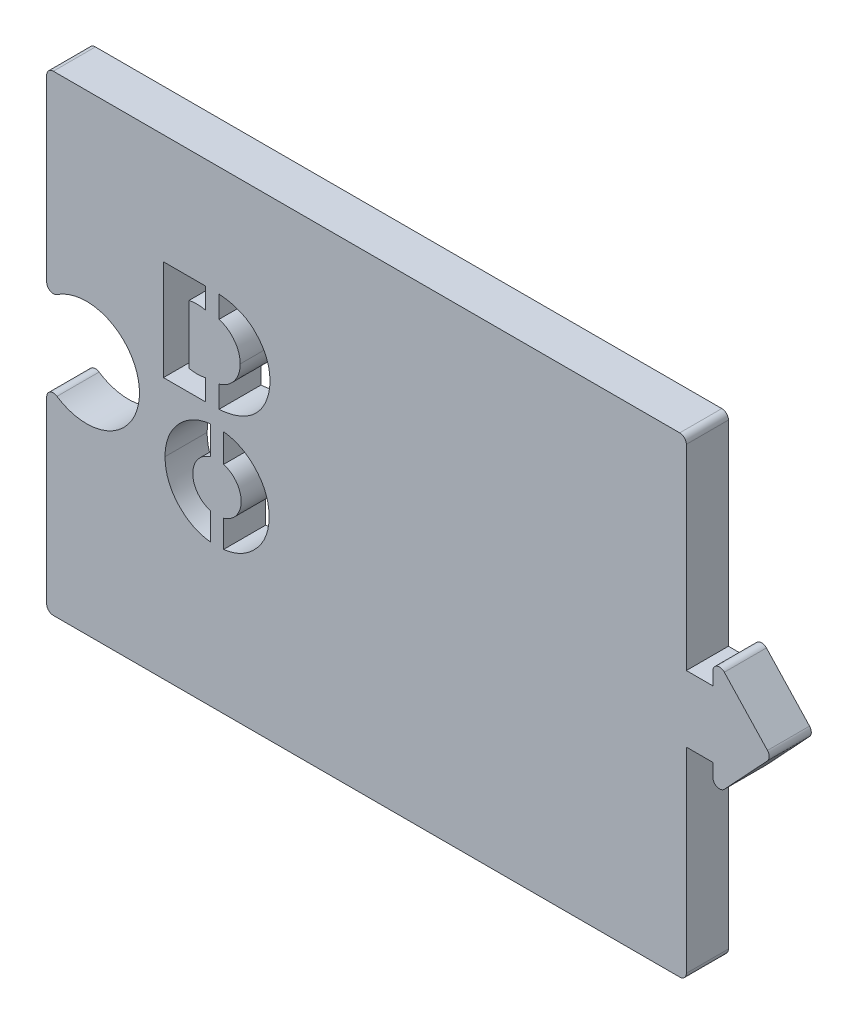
ISO-10303-21;
HEADER;
FILE_DESCRIPTION(('STEP AP214'),'2;1');
FILE_NAME('part.step','',(''),(''),'','','');
FILE_SCHEMA(('AUTOMOTIVE_DESIGN { 1 0 10303 214 1 1 1 1 }'));
ENDSEC;
DATA;
#1=APPLICATION_CONTEXT('core data for automotive mechanical design processes');
#2=APPLICATION_PROTOCOL_DEFINITION('international standard','automotive_design',2000,#1);
#3=PRODUCT_CONTEXT('',#1,'mechanical');
#4=PRODUCT('Part','Part','',(#3));
#5=PRODUCT_RELATED_PRODUCT_CATEGORY('part','',(#4));
#6=PRODUCT_DEFINITION_FORMATION('','',#4);
#7=PRODUCT_DEFINITION_CONTEXT('part definition',#1,'design');
#8=PRODUCT_DEFINITION('design','',#6,#7);
#9=PRODUCT_DEFINITION_SHAPE('','',#8);
#10=(LENGTH_UNIT() NAMED_UNIT(*) SI_UNIT(.MILLI.,.METRE.));
#11=(NAMED_UNIT(*) PLANE_ANGLE_UNIT() SI_UNIT($,.RADIAN.));
#12=(NAMED_UNIT(*) SI_UNIT($,.STERADIAN.) SOLID_ANGLE_UNIT());
#13=UNCERTAINTY_MEASURE_WITH_UNIT(LENGTH_MEASURE(1.E-05),#10,'distance_accuracy_value','');
#14=(GEOMETRIC_REPRESENTATION_CONTEXT(3) GLOBAL_UNCERTAINTY_ASSIGNED_CONTEXT((#13)) GLOBAL_UNIT_ASSIGNED_CONTEXT((#10,
#11,#12)) REPRESENTATION_CONTEXT('',''));
#15=CARTESIAN_POINT('',(0.,0.,0.));
#16=DIRECTION('',(0.,0.,1.));
#17=DIRECTION('',(1.,0.,0.));
#18=AXIS2_PLACEMENT_3D('',#15,#16,#17);
#19=CARTESIAN_POINT('',(11.9936486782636,28.6361270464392,0.));
#20=DIRECTION('',(-1.,0.,0.));
#21=DIRECTION('',(0.,-1.,0.));
#22=AXIS2_PLACEMENT_3D('',#19,#20,#21);
#23=PLANE('',#22);
#24=DIRECTION('',(0.,-1.,0.));
#25=VECTOR('',#24,1.);
#26=CARTESIAN_POINT('',(11.9936486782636,28.6361270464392,3.175));
#27=LINE('',#26,#25);
#28=CARTESIAN_POINT('',(11.9936486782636,27.2638561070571,3.175));
#29=VERTEX_POINT('',#28);
#30=CARTESIAN_POINT('',(11.9936486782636,25.6879455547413,3.175));
#31=VERTEX_POINT('',#30);
#32=EDGE_CURVE('E488',#29,#31,#27,.T.);
#33=ORIENTED_EDGE('',*,*,#32,.F.);
#34=DIRECTION('',(0.,0.,-1.));
#35=VECTOR('',#34,1.);
#36=CARTESIAN_POINT('',(11.9936486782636,27.2638561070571,0.));
#37=LINE('',#36,#35);
#38=CARTESIAN_POINT('',(11.9936486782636,27.2638561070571,0.));
#39=VERTEX_POINT('',#38);
#40=EDGE_CURVE('E480',#29,#39,#37,.T.);
#41=ORIENTED_EDGE('',*,*,#40,.T.);
#42=DIRECTION('',(0.,-1.,0.));
#43=VECTOR('',#42,1.);
#44=CARTESIAN_POINT('',(11.9936486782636,28.6361270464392,0.));
#45=LINE('',#44,#43);
#46=CARTESIAN_POINT('',(11.9936486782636,25.6879455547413,0.));
#47=VERTEX_POINT('',#46);
#48=EDGE_CURVE('E489',#39,#47,#45,.T.);
#49=ORIENTED_EDGE('',*,*,#48,.T.);
#50=DIRECTION('',(0.,0.,1.));
#51=VECTOR('',#50,1.);
#52=CARTESIAN_POINT('',(11.9936486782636,25.6879455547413,0.));
#53=LINE('',#52,#51);
#54=EDGE_CURVE('E728',#47,#31,#53,.T.);
#55=ORIENTED_EDGE('',*,*,#54,.T.);
#56=EDGE_LOOP('',(#33,#41,#49,#55));
#57=FACE_BOUND('',#56,.T.);
#58=ADVANCED_FACE('F33',(#57),#23,.T.);
#59=CARTESIAN_POINT('',(11.9936486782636,21.2722457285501,0.));
#60=DIRECTION('',(-1.,0.,0.));
#61=DIRECTION('',(0.,-1.,0.));
#62=AXIS2_PLACEMENT_3D('',#59,#60,#61);
#63=PLANE('',#62);
#64=DIRECTION('',(0.,-1.,0.));
#65=VECTOR('',#64,1.);
#66=CARTESIAN_POINT('',(11.9936486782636,21.2722457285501,0.));
#67=LINE('',#66,#65);
#68=CARTESIAN_POINT('',(11.9936486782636,21.2722457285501,0.));
#69=VERTEX_POINT('',#68);
#70=CARTESIAN_POINT('',(11.9936486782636,19.6945506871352,0.));
#71=VERTEX_POINT('',#70);
#72=EDGE_CURVE('E975',#69,#71,#67,.T.);
#73=ORIENTED_EDGE('',*,*,#72,.T.);
#74=DIRECTION('',(0.,0.,1.));
#75=VECTOR('',#74,1.);
#76=CARTESIAN_POINT('',(11.9936486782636,19.6945506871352,0.));
#77=LINE('',#76,#75);
#78=CARTESIAN_POINT('',(11.9936486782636,19.6945506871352,3.175));
#79=VERTEX_POINT('',#78);
#80=EDGE_CURVE('E483',#71,#79,#77,.T.);
#81=ORIENTED_EDGE('',*,*,#80,.T.);
#82=DIRECTION('',(0.,-1.,0.));
#83=VECTOR('',#82,1.);
#84=CARTESIAN_POINT('',(11.9936486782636,21.2722457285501,3.175));
#85=LINE('',#84,#83);
#86=CARTESIAN_POINT('',(11.9936486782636,21.2722457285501,3.175));
#87=VERTEX_POINT('',#86);
#88=EDGE_CURVE('E746',#87,#79,#85,.T.);
#89=ORIENTED_EDGE('',*,*,#88,.F.);
#90=DIRECTION('',(0.,0.,1.));
#91=VECTOR('',#90,1.);
#92=CARTESIAN_POINT('',(11.9936486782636,21.2722457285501,0.));
#93=LINE('',#92,#91);
#94=EDGE_CURVE('E779',#69,#87,#93,.T.);
#95=ORIENTED_EDGE('',*,*,#94,.F.);
#96=EDGE_LOOP('',(#73,#81,#89,#95));
#97=FACE_BOUND('',#96,.T.);
#98=ADVANCED_FACE('F514',(#97),#63,.T.);
#99=CARTESIAN_POINT('',(12.9936486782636,28.6361270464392,0.));
#100=DIRECTION('',(1.,0.,0.));
#101=DIRECTION('',(0.,0.,-1.));
#102=AXIS2_PLACEMENT_3D('',#99,#100,#101);
#103=PLANE('',#102);
#104=DIRECTION('',(0.,0.,1.));
#105=VECTOR('',#104,1.);
#106=CARTESIAN_POINT('',(12.9936486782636,27.2501997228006,0.));
#107=LINE('',#106,#105);
#108=CARTESIAN_POINT('',(12.9936486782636,27.2501997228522,3.175));
#109=VERTEX_POINT('',#108);
#110=CARTESIAN_POINT('',(12.9936486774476,27.250199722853,0.));
#111=VERTEX_POINT('',#110);
#112=EDGE_CURVE('E474',#109,#111,#107,.F.);
#113=ORIENTED_EDGE('',*,*,#112,.F.);
#114=DIRECTION('',(0.,1.,0.));
#115=VECTOR('',#114,1.);
#116=CARTESIAN_POINT('',(12.9936486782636,28.6361270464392,3.175));
#117=LINE('',#116,#115);
#118=CARTESIAN_POINT('',(12.9936486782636,25.5900602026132,3.175));
#119=VERTEX_POINT('',#118);
#120=EDGE_CURVE('E492',#119,#109,#117,.T.);
#121=ORIENTED_EDGE('',*,*,#120,.F.);
#122=DIRECTION('',(0.,0.,1.));
#123=VECTOR('',#122,1.);
#124=CARTESIAN_POINT('',(12.9936486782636,25.5900602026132,0.));
#125=LINE('',#124,#123);
#126=CARTESIAN_POINT('',(12.9936486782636,25.5900602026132,0.));
#127=VERTEX_POINT('',#126);
#128=EDGE_CURVE('E772',#127,#119,#125,.T.);
#129=ORIENTED_EDGE('',*,*,#128,.F.);
#130=DIRECTION('',(0.,1.,0.));
#131=VECTOR('',#130,1.);
#132=CARTESIAN_POINT('',(12.9936486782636,28.6361270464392,0.));
#133=LINE('',#132,#131);
#134=EDGE_CURVE('E718',#127,#111,#133,.T.);
#135=ORIENTED_EDGE('',*,*,#134,.T.);
#136=EDGE_LOOP('',(#113,#121,#129,#135));
#137=FACE_BOUND('',#136,.T.);
#138=ADVANCED_FACE('F700',(#137),#103,.T.);
#139=CARTESIAN_POINT('',(14.5976757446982,23.4800956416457,0.));
#140=CARTESIAN_POINT('',(14.6194518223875,24.4251720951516,0.));
#141=CARTESIAN_POINT('',(13.9311921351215,25.3522459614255,0.));
#142=CARTESIAN_POINT('',(12.9936486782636,25.5900602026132,0.));
#143=B_SPLINE_CURVE_WITH_KNOTS('',3,(#139,#140,#141,#142),.UNSPECIFIED.,.F.,.F.,(4,4),(0.,1.),.UNSPECIFIED.);
#144=DIRECTION('',(0.,0.,1.));
#145=VECTOR('',#144,1.);
#146=SURFACE_OF_LINEAR_EXTRUSION('',#143,#145);
#147=CARTESIAN_POINT('',(14.5976757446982,23.4800956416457,3.175));
#148=CARTESIAN_POINT('',(14.6194518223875,24.4251720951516,3.175));
#149=CARTESIAN_POINT('',(13.9311921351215,25.3522459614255,3.175));
#150=CARTESIAN_POINT('',(12.9936486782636,25.5900602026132,3.175));
#151=B_SPLINE_CURVE_WITH_KNOTS('',3,(#147,#148,#149,#150),.UNSPECIFIED.,.F.,.F.,(4,4),(0.,1.),.UNSPECIFIED.);
#152=CARTESIAN_POINT('',(14.5976757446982,23.4800956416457,3.175));
#153=VERTEX_POINT('',#152);
#154=EDGE_CURVE('E759',#153,#119,#151,.T.);
#155=ORIENTED_EDGE('',*,*,#154,.F.);
#156=DIRECTION('',(0.,0.,1.));
#157=VECTOR('',#156,1.);
#158=CARTESIAN_POINT('',(14.5976757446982,23.4800956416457,0.));
#159=LINE('',#158,#157);
#160=CARTESIAN_POINT('',(14.5976757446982,23.4800956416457,0.));
#161=VERTEX_POINT('',#160);
#162=EDGE_CURVE('E774',#161,#153,#159,.T.);
#163=ORIENTED_EDGE('',*,*,#162,.F.);
#164=EDGE_CURVE('E712',#161,#127,#143,.T.);
#165=ORIENTED_EDGE('',*,*,#164,.T.);
#166=ORIENTED_EDGE('',*,*,#128,.T.);
#167=EDGE_LOOP('',(#155,#163,#165,#166));
#168=FACE_BOUND('',#167,.T.);
#169=ADVANCED_FACE('F703',(#168),#146,.T.);
#170=CARTESIAN_POINT('',(12.9936486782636,21.3701310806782,0.));
#171=CARTESIAN_POINT('',(13.9311921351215,21.6079453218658,0.));
#172=CARTESIAN_POINT('',(14.6194518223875,22.5350191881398,0.));
#173=CARTESIAN_POINT('',(14.5976757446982,23.4800956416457,0.));
#174=B_SPLINE_CURVE_WITH_KNOTS('',3,(#170,#171,#172,#173),.UNSPECIFIED.,.F.,.F.,(4,4),(0.,1.),.UNSPECIFIED.);
#175=DIRECTION('',(0.,0.,1.));
#176=VECTOR('',#175,1.);
#177=SURFACE_OF_LINEAR_EXTRUSION('',#174,#176);
#178=CARTESIAN_POINT('',(12.9936486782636,21.3701310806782,3.175));
#179=CARTESIAN_POINT('',(13.9311921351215,21.6079453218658,3.175));
#180=CARTESIAN_POINT('',(14.6194518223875,22.5350191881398,3.175));
#181=CARTESIAN_POINT('',(14.5976757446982,23.4800956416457,3.175));
#182=B_SPLINE_CURVE_WITH_KNOTS('',3,(#178,#179,#180,#181),.UNSPECIFIED.,.F.,.F.,(4,4),(0.,1.),.UNSPECIFIED.);
#183=CARTESIAN_POINT('',(12.9936486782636,21.3701310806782,3.175));
#184=VERTEX_POINT('',#183);
#185=EDGE_CURVE('E754',#184,#153,#182,.T.);
#186=ORIENTED_EDGE('',*,*,#185,.F.);
#187=DIRECTION('',(0.,0.,1.));
#188=VECTOR('',#187,1.);
#189=CARTESIAN_POINT('',(12.9936486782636,21.3701310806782,0.));
#190=LINE('',#189,#188);
#191=CARTESIAN_POINT('',(12.9936486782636,21.3701310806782,0.));
#192=VERTEX_POINT('',#191);
#193=EDGE_CURVE('E776',#192,#184,#190,.T.);
#194=ORIENTED_EDGE('',*,*,#193,.F.);
#195=EDGE_CURVE('E719',#192,#161,#174,.T.);
#196=ORIENTED_EDGE('',*,*,#195,.T.);
#197=ORIENTED_EDGE('',*,*,#162,.T.);
#198=EDGE_LOOP('',(#186,#194,#196,#197));
#199=FACE_BOUND('',#198,.T.);
#200=ADVANCED_FACE('F708',(#199),#177,.T.);
#201=CARTESIAN_POINT('',(12.9936486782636,21.3701310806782,0.));
#202=DIRECTION('',(1.,0.,0.));
#203=DIRECTION('',(0.,0.,-1.));
#204=AXIS2_PLACEMENT_3D('',#201,#202,#203);
#205=PLANE('',#204);
#206=DIRECTION('',(0.,0.,1.));
#207=VECTOR('',#206,1.);
#208=CARTESIAN_POINT('',(12.9936486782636,19.7133012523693,0.));
#209=LINE('',#208,#207);
#210=CARTESIAN_POINT('',(12.9936486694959,19.7133012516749,0.));
#211=VERTEX_POINT('',#210);
#212=CARTESIAN_POINT('',(12.9936486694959,19.7133012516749,3.175));
#213=VERTEX_POINT('',#212);
#214=EDGE_CURVE('E486',#211,#213,#209,.T.);
#215=ORIENTED_EDGE('',*,*,#214,.F.);
#216=DIRECTION('',(0.,1.,0.));
#217=VECTOR('',#216,1.);
#218=CARTESIAN_POINT('',(12.9936486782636,21.3701310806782,0.));
#219=LINE('',#218,#217);
#220=EDGE_CURVE('E979',#211,#192,#219,.T.);
#221=ORIENTED_EDGE('',*,*,#220,.T.);
#222=ORIENTED_EDGE('',*,*,#193,.T.);
#223=DIRECTION('',(0.,1.,0.));
#224=VECTOR('',#223,1.);
#225=CARTESIAN_POINT('',(12.9936486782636,21.3701310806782,3.175));
#226=LINE('',#225,#224);
#227=EDGE_CURVE('E752',#213,#184,#226,.T.);
#228=ORIENTED_EDGE('',*,*,#227,.F.);
#229=EDGE_LOOP('',(#215,#221,#222,#228));
#230=FACE_BOUND('',#229,.T.);
#231=ADVANCED_FACE('F991',(#230),#205,.T.);
#232=CARTESIAN_POINT('',(10.7377540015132,21.2600100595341,0.));
#233=CARTESIAN_POINT('',(11.3685048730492,21.1290190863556,0.));
#234=CARTESIAN_POINT('',(11.9936486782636,21.2722457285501,0.));
#235=B_SPLINE_CURVE_WITH_KNOTS('',2,(#232,#233,#234),.UNSPECIFIED.,.F.,.F.,(3,3),(0.,1.),.UNSPECIFIED.);
#236=DIRECTION('',(0.,0.,1.));
#237=VECTOR('',#236,1.);
#238=SURFACE_OF_LINEAR_EXTRUSION('',#235,#237);
#239=CARTESIAN_POINT('',(10.7377540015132,21.2600100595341,3.175));
#240=CARTESIAN_POINT('',(11.3685048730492,21.1290190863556,3.175));
#241=CARTESIAN_POINT('',(11.9936486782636,21.2722457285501,3.175));
#242=B_SPLINE_CURVE_WITH_KNOTS('',2,(#239,#240,#241),.UNSPECIFIED.,.F.,.F.,(3,3),(0.,1.),.UNSPECIFIED.);
#243=CARTESIAN_POINT('',(10.7377540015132,21.2600100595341,3.175));
#244=VERTEX_POINT('',#243);
#245=EDGE_CURVE('E741',#244,#87,#242,.T.);
#246=ORIENTED_EDGE('',*,*,#245,.F.);
#247=DIRECTION('',(0.,0.,1.));
#248=VECTOR('',#247,1.);
#249=CARTESIAN_POINT('',(10.7377540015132,21.2600100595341,0.));
#250=LINE('',#249,#248);
#251=CARTESIAN_POINT('',(10.7377540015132,21.2600100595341,0.));
#252=VERTEX_POINT('',#251);
#253=EDGE_CURVE('E781',#252,#244,#250,.T.);
#254=ORIENTED_EDGE('',*,*,#253,.F.);
#255=EDGE_CURVE('E980',#252,#69,#235,.T.);
#256=ORIENTED_EDGE('',*,*,#255,.T.);
#257=ORIENTED_EDGE('',*,*,#94,.T.);
#258=EDGE_LOOP('',(#246,#254,#256,#257));
#259=FACE_BOUND('',#258,.T.);
#260=ADVANCED_FACE('F988',(#259),#238,.T.);
#261=CARTESIAN_POINT('',(10.7377540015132,25.7001812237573,0.));
#262=DIRECTION('',(-1.,0.,0.));
#263=DIRECTION('',(0.,0.,1.));
#264=AXIS2_PLACEMENT_3D('',#261,#262,#263);
#265=PLANE('',#264);
#266=DIRECTION('',(0.,-1.,0.));
#267=VECTOR('',#266,1.);
#268=CARTESIAN_POINT('',(10.7377540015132,25.7001812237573,3.175));
#269=LINE('',#268,#267);
#270=CARTESIAN_POINT('',(10.7377540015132,25.7001812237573,3.175));
#271=VERTEX_POINT('',#270);
#272=EDGE_CURVE('E735',#271,#244,#269,.T.);
#273=ORIENTED_EDGE('',*,*,#272,.F.);
#274=DIRECTION('',(0.,0.,1.));
#275=VECTOR('',#274,1.);
#276=CARTESIAN_POINT('',(10.7377540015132,25.7001812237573,0.));
#277=LINE('',#276,#275);
#278=CARTESIAN_POINT('',(10.7377540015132,25.7001812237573,0.));
#279=VERTEX_POINT('',#278);
#280=EDGE_CURVE('E783',#279,#271,#277,.T.);
#281=ORIENTED_EDGE('',*,*,#280,.F.);
#282=DIRECTION('',(0.,-1.,0.));
#283=VECTOR('',#282,1.);
#284=CARTESIAN_POINT('',(10.7377540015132,25.7001812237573,0.));
#285=LINE('',#284,#283);
#286=EDGE_CURVE('E498',#279,#252,#285,.T.);
#287=ORIENTED_EDGE('',*,*,#286,.T.);
#288=ORIENTED_EDGE('',*,*,#253,.T.);
#289=EDGE_LOOP('',(#273,#281,#287,#288));
#290=FACE_BOUND('',#289,.T.);
#291=ADVANCED_FACE('F509',(#290),#265,.T.);
#292=CARTESIAN_POINT('',(11.9936486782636,25.6879455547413,0.));
#293=CARTESIAN_POINT('',(11.3685048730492,25.8311721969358,0.));
#294=CARTESIAN_POINT('',(10.7377540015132,25.7001812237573,0.));
#295=B_SPLINE_CURVE_WITH_KNOTS('',2,(#292,#293,#294),.UNSPECIFIED.,.F.,.F.,(3,3),(0.,1.),.UNSPECIFIED.);
#296=DIRECTION('',(0.,0.,1.));
#297=VECTOR('',#296,1.);
#298=SURFACE_OF_LINEAR_EXTRUSION('',#295,#297);
#299=CARTESIAN_POINT('',(11.9936486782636,25.6879455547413,3.175));
#300=CARTESIAN_POINT('',(11.3685048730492,25.8311721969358,3.175));
#301=CARTESIAN_POINT('',(10.7377540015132,25.7001812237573,3.175));
#302=B_SPLINE_CURVE_WITH_KNOTS('',2,(#299,#300,#301),.UNSPECIFIED.,.F.,.F.,(3,3),(0.,1.),.UNSPECIFIED.);
#303=EDGE_CURVE('E730',#31,#271,#302,.T.);
#304=ORIENTED_EDGE('',*,*,#303,.F.);
#305=ORIENTED_EDGE('',*,*,#54,.F.);
#306=EDGE_CURVE('E491',#47,#279,#295,.T.);
#307=ORIENTED_EDGE('',*,*,#306,.T.);
#308=ORIENTED_EDGE('',*,*,#280,.T.);
#309=EDGE_LOOP('',(#304,#305,#307,#308));
#310=FACE_BOUND('',#309,.T.);
#311=ADVANCED_FACE('F504',(#310),#298,.T.);
#312=CARTESIAN_POINT('',(3.,17.78,3.175));
#313=DIRECTION('',(0.,0.,1.));
#314=DIRECTION('',(1.,0.,0.));
#315=AXIS2_PLACEMENT_3D('',#312,#313,#314);
#316=PLANE('',#315);
#317=CARTESIAN_POINT('',(8.93162431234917,14.5913882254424,3.175));
#318=CARTESIAN_POINT('',(8.93493384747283,14.7239398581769,3.175));
#319=CARTESIAN_POINT('',(8.94145806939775,14.985244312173,3.175));
#320=CARTESIAN_POINT('',(8.99483056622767,15.3694265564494,3.175));
#321=CARTESIAN_POINT('',(9.08455391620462,15.7373399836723,3.175));
#322=CARTESIAN_POINT('',(9.2070680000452,16.0907677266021,3.175));
#323=CARTESIAN_POINT('',(9.36767152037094,16.4271462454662,3.175));
#324=CARTESIAN_POINT('',(9.56093262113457,16.7494541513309,3.175));
#325=CARTESIAN_POINT('',(9.79242550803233,17.0540315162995,3.175));
#326=CARTESIAN_POINT('',(10.054907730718,17.340311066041,3.175));
#327=CARTESIAN_POINT('',(10.340850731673,17.6035890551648,3.175));
#328=CARTESIAN_POINT('',(10.6483387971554,17.8323095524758,3.175));
#329=CARTESIAN_POINT('',(10.9698033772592,18.0281074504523,3.175));
#330=CARTESIAN_POINT('',(11.3082242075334,18.1857644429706,3.175));
#331=CARTESIAN_POINT('',(11.6602300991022,18.3117570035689,3.175));
#332=CARTESIAN_POINT('',(12.0290689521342,18.3983160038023,3.175));
#333=CARTESIAN_POINT('',(12.4128995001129,18.4525329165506,3.175));
#334=CARTESIAN_POINT('',(12.6742367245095,18.4589389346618,3.175));
#335=CARTESIAN_POINT('',(12.8068049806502,18.4621885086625,3.175));
#336=B_SPLINE_CURVE_WITH_KNOTS('',3,(#317,#318,#319,#320,#321,#322,#323,#324,#325,#326,#327,
#328,#329,#330,#331,#332,#333,#334,#335),.UNSPECIFIED.,.F.,.F.,(4,1,1,1,1,1,1,1,1,1,1,1,1,1,1,1,
4),(0.,0.0651656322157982,0.128463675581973,0.190288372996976,0.251148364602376,
0.312067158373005,0.373269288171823,0.435643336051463,0.499851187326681,0.564059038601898,
0.626480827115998,0.688011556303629,0.748828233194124,0.809767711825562,0.871536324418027,
0.934834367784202,1.),.UNSPECIFIED.);
#337=CARTESIAN_POINT('',(8.93162431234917,14.5913882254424,3.175));
#338=VERTEX_POINT('',#337);
#339=CARTESIAN_POINT('',(12.3471660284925,18.4388719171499,3.175));
#340=VERTEX_POINT('',#339);
#341=EDGE_CURVE('E653',#338,#340,#336,.T.);
#342=ORIENTED_EDGE('',*,*,#341,.T.);
#343=DIRECTION('',(0.,-1.,0.));
#344=VECTOR('',#343,1.);
#345=CARTESIAN_POINT('',(12.3471660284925,18.8326323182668,3.175));
#346=LINE('',#345,#344);
#347=CARTESIAN_POINT('',(12.3471660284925,16.2918448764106,3.175));
#348=VERTEX_POINT('',#347);
#349=EDGE_CURVE('E363',#340,#348,#346,.T.);
#350=ORIENTED_EDGE('',*,*,#349,.T.);
#351=CARTESIAN_POINT('',(12.8471004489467,14.535943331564,3.175));
#352=DIRECTION('',(0.,0.,1.));
#353=DIRECTION('',(1.,0.,0.));
#354=AXIS2_PLACEMENT_3D('',#351,#352,#353);
#355=CIRCLE('',#354,1.82568470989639);
#356=CARTESIAN_POINT('',(12.3471660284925,12.7800417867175,3.175));
#357=VERTEX_POINT('',#356);
#358=EDGE_CURVE('E345',#348,#357,#355,.T.);
#359=ORIENTED_EDGE('',*,*,#358,.T.);
#360=DIRECTION('',(0.,-1.,0.));
#361=VECTOR('',#360,1.);
#362=CARTESIAN_POINT('',(12.3471660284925,12.7800417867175,3.175));
#363=LINE('',#362,#361);
#364=CARTESIAN_POINT('',(12.3471660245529,10.7292491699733,3.175));
#365=VERTEX_POINT('',#364);
#366=EDGE_CURVE('E366',#357,#365,#363,.T.);
#367=ORIENTED_EDGE('',*,*,#366,.T.);
#368=CARTESIAN_POINT('',(12.8068049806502,10.7059866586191,3.175));
#369=CARTESIAN_POINT('',(12.6742501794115,10.7092835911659,3.175));
#370=CARTESIAN_POINT('',(12.4129394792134,10.7157829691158,3.175));
#371=CARTESIAN_POINT('',(12.028333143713,10.7694017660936,3.175));
#372=CARTESIAN_POINT('',(11.6598060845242,10.8586406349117,3.175));
#373=CARTESIAN_POINT('',(11.3060066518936,10.9815118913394,3.175));
#374=CARTESIAN_POINT('',(10.9688511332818,11.1421141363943,3.175));
#375=CARTESIAN_POINT('',(10.6463060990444,11.3369766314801,3.175));
#376=CARTESIAN_POINT('',(10.3399126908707,11.5677403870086,3.175));
#377=CARTESIAN_POINT('',(10.0530403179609,11.8308217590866,3.175));
#378=CARTESIAN_POINT('',(9.79067753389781,12.1180594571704,3.175));
#379=CARTESIAN_POINT('',(9.56148125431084,12.4255849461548,3.175));
#380=CARTESIAN_POINT('',(9.36533433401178,12.74740100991,3.175));
#381=CARTESIAN_POINT('',(9.20808592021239,13.0870174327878,3.175));
#382=CARTESIAN_POINT('',(9.08203972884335,13.4404483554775,3.175));
#383=CARTESIAN_POINT('',(8.99550170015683,13.8107471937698,3.175));
#384=CARTESIAN_POINT('',(8.94128019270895,14.1960282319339,3.175));
#385=CARTESIAN_POINT('',(8.93487390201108,14.4583337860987,3.175));
#386=CARTESIAN_POINT('',(8.93162431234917,14.5913882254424,3.175));
#387=B_SPLINE_CURVE_WITH_KNOTS('',3,(#368,#369,#370,#371,#372,#373,#374,#375,#376,#377,#378,
#379,#380,#381,#382,#383,#384,#385,#386),.UNSPECIFIED.,.F.,.F.,(4,1,1,1,1,1,1,1,1,1,1,1,1,1,1,1,
4),(0.,0.065030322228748,0.128196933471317,0.190125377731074,0.250858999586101,
0.311651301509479,0.373054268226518,0.43548960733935,0.499564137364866,0.563815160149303,
0.626107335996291,0.68751030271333,0.748416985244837,0.809455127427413,0.871327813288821,
0.934731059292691,1.),.UNSPECIFIED.);
#388=EDGE_CURVE('E660',#365,#338,#387,.T.);
#389=ORIENTED_EDGE('',*,*,#388,.T.);
#390=EDGE_LOOP('',(#342,#350,#359,#367,#389));
#391=FACE_BOUND('',#390,.T.);
#392=CARTESIAN_POINT('',(16.7812743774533,14.5913882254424,3.175));
#393=CARTESIAN_POINT('',(16.7781512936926,14.4602662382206,3.175));
#394=CARTESIAN_POINT('',(16.7719937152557,14.2017416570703,3.175));
#395=CARTESIAN_POINT('',(16.7158689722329,13.8217883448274,3.175));
#396=CARTESIAN_POINT('',(16.6271893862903,13.4563366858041,3.175));
#397=CARTESIAN_POINT('',(16.5023574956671,13.1047901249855,3.175));
#398=CARTESIAN_POINT('',(16.340587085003,12.7673151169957,3.175));
#399=CARTESIAN_POINT('',(16.1429675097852,12.4439088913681,3.175));
#400=CARTESIAN_POINT('',(15.9084184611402,12.135919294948,3.175));
#401=CARTESIAN_POINT('',(15.6433979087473,11.8449072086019,3.175));
#402=CARTESIAN_POINT('',(15.3527330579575,11.5776017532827,3.175));
#403=CARTESIAN_POINT('',(15.04034213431,11.3438156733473,3.175));
#404=CARTESIAN_POINT('',(14.7100206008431,11.147551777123,3.175));
#405=CARTESIAN_POINT('',(14.3629897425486,10.9854341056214,3.175));
#406=CARTESIAN_POINT('',(13.9984065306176,10.8595644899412,3.175));
#407=CARTESIAN_POINT('',(13.6161799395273,10.7711932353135,3.175));
#408=CARTESIAN_POINT('',(13.2173036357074,10.715165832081,3.175));
#409=CARTESIAN_POINT('',(12.9452201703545,10.7090817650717,3.175));
#410=CARTESIAN_POINT('',(12.8068049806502,10.7059866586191,3.175));
#411=B_SPLINE_CURVE_WITH_KNOTS('',3,(#392,#393,#394,#395,#396,#397,#398,#399,#400,#401,#402,
#403,#404,#405,#406,#407,#408,#409,#410),.UNSPECIFIED.,.F.,.F.,(4,1,1,1,1,1,1,1,1,1,1,1,1,1,1,1,
4),(0.,0.0635081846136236,0.125214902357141,0.185679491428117,0.24550776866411,0.30563931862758,
0.366719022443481,0.42884396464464,0.492955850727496,0.557226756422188,0.619917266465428,
0.681683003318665,0.743094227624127,0.805226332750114,0.86821384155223,0.9329573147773,1.),.UNSPECIFIED.);
#412=CARTESIAN_POINT('',(16.7812743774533,14.5913882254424,3.175));
#413=VERTEX_POINT('',#412);
#414=CARTESIAN_POINT('',(13.3471660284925,10.7360853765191,3.175));
#415=VERTEX_POINT('',#414);
#416=EDGE_CURVE('E668',#413,#415,#411,.T.);
#417=ORIENTED_EDGE('',*,*,#416,.T.);
#418=DIRECTION('',(0.,1.,0.));
#419=VECTOR('',#418,1.);
#420=CARTESIAN_POINT('',(13.3471660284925,12.7800791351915,3.175));
#421=LINE('',#420,#419);
#422=CARTESIAN_POINT('',(13.3471660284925,12.7800791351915,3.175));
#423=VERTEX_POINT('',#422);
#424=EDGE_CURVE('E368',#415,#423,#421,.T.);
#425=ORIENTED_EDGE('',*,*,#424,.T.);
#426=CARTESIAN_POINT('',(12.8471004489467,14.535943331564,3.175));
#427=DIRECTION('',(0.,0.,1.));
#428=DIRECTION('',(1.,0.,0.));
#429=AXIS2_PLACEMENT_3D('',#426,#427,#428);
#430=CIRCLE('',#429,1.82568470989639);
#431=CARTESIAN_POINT('',(13.3471660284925,16.2918075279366,3.175));
#432=VERTEX_POINT('',#431);
#433=EDGE_CURVE('E370',#423,#432,#430,.T.);
#434=ORIENTED_EDGE('',*,*,#433,.T.);
#435=DIRECTION('',(0.,1.,0.));
#436=VECTOR('',#435,1.);
#437=CARTESIAN_POINT('',(13.3471660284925,18.8326323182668,3.175));
#438=LINE('',#437,#436);
#439=CARTESIAN_POINT('',(13.3471660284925,18.4321033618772,3.175));
#440=VERTEX_POINT('',#439);
#441=EDGE_CURVE('E339',#432,#440,#438,.T.);
#442=ORIENTED_EDGE('',*,*,#441,.T.);
#443=CARTESIAN_POINT('',(12.8068049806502,18.4621885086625,3.175));
#444=CARTESIAN_POINT('',(12.9452182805,18.459087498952,3.175));
#445=CARTESIAN_POINT('',(13.2172980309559,18.4529918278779,3.175));
#446=CARTESIAN_POINT('',(13.6162012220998,18.3970484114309,3.175));
#447=CARTESIAN_POINT('',(13.9977261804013,18.3085100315,3.175));
#448=CARTESIAN_POINT('',(14.3625256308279,18.1839100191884,3.175));
#449=CARTESIAN_POINT('',(14.7096850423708,18.0223975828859,3.175));
#450=CARTESIAN_POINT('',(15.0403786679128,17.8258505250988,3.175));
#451=CARTESIAN_POINT('',(15.3522733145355,17.5920114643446,3.175));
#452=CARTESIAN_POINT('',(15.6434261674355,17.3262941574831,3.175));
#453=CARTESIAN_POINT('',(15.9083451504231,17.03663063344,3.175));
#454=CARTESIAN_POINT('',(16.1430093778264,16.7301731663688,3.175));
#455=CARTESIAN_POINT('',(16.3400919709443,16.408451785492,3.175));
#456=CARTESIAN_POINT('',(16.5030681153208,16.0729663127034,3.175));
#457=CARTESIAN_POINT('',(16.626832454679,15.722432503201,3.175));
#458=CARTESIAN_POINT('',(16.7159364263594,15.3581075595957,3.175));
#459=CARTESIAN_POINT('',(16.7719775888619,14.9795746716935,3.175));
#460=CARTESIAN_POINT('',(16.7781457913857,14.7220220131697,3.175));
#461=CARTESIAN_POINT('',(16.7812743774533,14.5913882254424,3.175));
#462=B_SPLINE_CURVE_WITH_KNOTS('',3,(#443,#444,#445,#446,#447,#448,#449,#450,#451,#452,#453,
#454,#455,#456,#457,#458,#459,#460,#461),.UNSPECIFIED.,.F.,.F.,(4,1,1,1,1,1,1,1,1,1,1,1,1,1,1,1,
4),(0.,0.0671724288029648,0.132041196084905,0.195150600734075,0.257102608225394,
0.31884694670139,0.380732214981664,0.443544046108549,0.507780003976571,0.571841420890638,
0.633898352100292,0.694894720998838,0.754716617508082,0.814660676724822,0.875012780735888,
0.936604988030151,1.),.UNSPECIFIED.);
#463=EDGE_CURVE('E658',#440,#413,#462,.T.);
#464=ORIENTED_EDGE('',*,*,#463,.T.);
#465=EDGE_LOOP('',(#417,#425,#434,#442,#464));
#466=FACE_BOUND('',#465,.T.);
#467=DIRECTION('',(-1.,0.,0.));
#468=VECTOR('',#467,1.);
#469=CARTESIAN_POINT('',(3.,27.2638561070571,3.175));
#470=LINE('',#469,#468);
#471=CARTESIAN_POINT('',(8.80975336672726,27.2638561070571,3.175));
#472=VERTEX_POINT('',#471);
#473=EDGE_CURVE('E920',#29,#472,#470,.T.);
#474=ORIENTED_EDGE('',*,*,#473,.F.);
#475=ORIENTED_EDGE('',*,*,#32,.T.);
#476=ORIENTED_EDGE('',*,*,#303,.T.);
#477=ORIENTED_EDGE('',*,*,#272,.T.);
#478=ORIENTED_EDGE('',*,*,#245,.T.);
#479=ORIENTED_EDGE('',*,*,#88,.T.);
#480=DIRECTION('',(1.,0.,0.));
#481=VECTOR('',#480,1.);
#482=CARTESIAN_POINT('',(3.,19.6945506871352,3.175));
#483=LINE('',#482,#481);
#484=CARTESIAN_POINT('',(8.80975336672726,19.6945506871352,3.175));
#485=VERTEX_POINT('',#484);
#486=EDGE_CURVE('E387',#485,#79,#483,.T.);
#487=ORIENTED_EDGE('',*,*,#486,.F.);
#488=DIRECTION('',(0.,-1.,0.));
#489=VECTOR('',#488,1.);
#490=CARTESIAN_POINT('',(8.80975336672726,17.78,3.175));
#491=LINE('',#490,#489);
#492=EDGE_CURVE('E916',#472,#485,#491,.T.);
#493=ORIENTED_EDGE('',*,*,#492,.F.);
#494=EDGE_LOOP('',(#474,#475,#476,#477,#478,#479,#487,#493));
#495=FACE_BOUND('',#494,.T.);
#496=CARTESIAN_POINT('',(16.846299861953,23.4646021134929,3.175));
#497=CARTESIAN_POINT('',(16.8449929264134,23.3837534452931,3.175));
#498=CARTESIAN_POINT('',(16.8423814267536,23.2222028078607,3.175));
#499=CARTESIAN_POINT('',(16.8183039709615,22.9816826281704,3.175));
#500=CARTESIAN_POINT('',(16.7788366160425,22.743640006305,3.175));
#501=CARTESIAN_POINT('',(16.7228783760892,22.5087639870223,3.175));
#502=CARTESIAN_POINT('',(16.6530734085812,22.2758639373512,3.175));
#503=CARTESIAN_POINT('',(16.5662480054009,22.0458189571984,3.175));
#504=CARTESIAN_POINT('',(16.4640422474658,21.8187576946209,3.175));
#505=CARTESIAN_POINT('',(16.3479273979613,21.5951021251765,3.175));
#506=CARTESIAN_POINT('',(16.2149806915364,21.379606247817,3.175));
#507=CARTESIAN_POINT('',(16.0681485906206,21.1729899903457,3.175));
#508=CARTESIAN_POINT('',(15.9039434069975,20.9801128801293,3.175));
#509=CARTESIAN_POINT('',(15.7243508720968,20.7995402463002,3.175));
#510=CARTESIAN_POINT('',(15.530551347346,20.6301847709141,3.175));
#511=CARTESIAN_POINT('',(15.3204738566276,20.4733142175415,3.175));
#512=CARTESIAN_POINT('',(15.0951400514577,20.3291600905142,3.175));
#513=CARTESIAN_POINT('',(14.8558048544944,20.1957602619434,3.175));
#514=CARTESIAN_POINT('',(14.6019719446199,20.0778628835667,3.175));
#515=CARTESIAN_POINT('',(14.334873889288,19.9758233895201,3.175));
#516=CARTESIAN_POINT('',(14.0558843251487,19.8873054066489,3.175));
#517=CARTESIAN_POINT('',(13.7627126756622,19.8184837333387,3.175));
#518=CARTESIAN_POINT('',(13.4572692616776,19.762290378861,3.175));
#519=CARTESIAN_POINT('',(13.1387976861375,19.7242377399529,3.175));
#520=CARTESIAN_POINT('',(12.8080346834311,19.697689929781,3.175));
#521=CARTESIAN_POINT('',(12.5832671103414,19.6956097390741,3.175));
#522=CARTESIAN_POINT('',(12.4688350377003,19.6945506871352,3.175));
#523=B_SPLINE_CURVE_WITH_KNOTS('',3,(#496,#497,#498,#499,#500,#501,#502,#503,#504,#505,#506,
#507,#508,#509,#510,#511,#512,#513,#514,#515,#516,#517,#518,#519,#520,#521,#522),.UNSPECIFIED.,
.F.,.F.,(4,1,1,1,1,1,1,1,1,1,1,1,1,1,1,1,1,1,1,1,1,1,1,1,4),(0.,0.0373640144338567,
0.074660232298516,0.111610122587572,0.148827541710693,0.186194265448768,0.223928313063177,
0.262397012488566,0.301240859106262,0.340328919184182,0.379350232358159,0.418297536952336,
0.457274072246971,0.496978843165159,0.537160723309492,0.578349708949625,0.620546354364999,
0.663727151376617,0.707598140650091,0.752640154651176,0.798914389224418,0.846706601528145,
0.89612750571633,0.947117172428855,1.),.UNSPECIFIED.);
#524=CARTESIAN_POINT('',(16.846299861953,23.4646021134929,3.175));
#525=VERTEX_POINT('',#524);
#526=EDGE_CURVE('E901',#525,#213,#523,.T.);
#527=ORIENTED_EDGE('',*,*,#526,.T.);
#528=ORIENTED_EDGE('',*,*,#227,.T.);
#529=ORIENTED_EDGE('',*,*,#185,.T.);
#530=ORIENTED_EDGE('',*,*,#154,.T.);
#531=ORIENTED_EDGE('',*,*,#120,.T.);
#532=CARTESIAN_POINT('',(12.5462218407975,27.2638561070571,3.175));
#533=CARTESIAN_POINT('',(12.6314121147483,27.2630295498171,3.175));
#534=CARTESIAN_POINT('',(12.7994623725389,27.2613990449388,3.175));
#535=CARTESIAN_POINT('',(13.0473916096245,27.24806660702,3.175));
#536=CARTESIAN_POINT('',(13.2879627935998,27.2259897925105,3.175));
#537=CARTESIAN_POINT('',(13.5210674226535,27.1963436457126,3.175));
#538=CARTESIAN_POINT('',(13.7462651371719,27.1543669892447,3.175));
#539=CARTESIAN_POINT('',(13.9642947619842,27.1069342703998,3.175));
#540=CARTESIAN_POINT('',(14.1747173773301,27.0496806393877,3.175));
#541=CARTESIAN_POINT('',(14.3783981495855,26.9846544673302,3.175));
#542=CARTESIAN_POINT('',(14.5735370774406,26.9076578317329,3.175));
#543=CARTESIAN_POINT('',(14.7628423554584,26.825864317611,3.175));
#544=CARTESIAN_POINT('',(14.9422937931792,26.7305514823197,3.175));
#545=CARTESIAN_POINT('',(15.1168553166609,26.6313003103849,3.175));
#546=CARTESIAN_POINT('',(15.2818906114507,26.5193496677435,3.175));
#547=CARTESIAN_POINT('',(15.4393815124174,26.3994390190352,3.175));
#548=CARTESIAN_POINT('',(15.5910702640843,26.2724132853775,3.175));
#549=CARTESIAN_POINT('',(15.7791548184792,26.0903433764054,3.175));
#550=CARTESIAN_POINT('',(15.9950833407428,25.8516236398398,3.175));
#551=CARTESIAN_POINT('',(16.2233099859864,25.5497321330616,3.175));
#552=CARTESIAN_POINT('',(16.415957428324,25.2344103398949,3.175));
#553=CARTESIAN_POINT('',(16.5725834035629,24.9053252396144,3.175));
#554=CARTESIAN_POINT('',(16.6969546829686,24.5639397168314,3.175));
#555=CARTESIAN_POINT('',(16.7817881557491,24.2081638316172,3.175));
#556=CARTESIAN_POINT('',(16.8366496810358,23.8405886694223,3.175));
#557=CARTESIAN_POINT('',(16.8430593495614,23.5908576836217,3.175));
#558=CARTESIAN_POINT('',(16.846299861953,23.4646021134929,3.175));
#559=B_SPLINE_CURVE_WITH_KNOTS('',3,(#532,#533,#534,#535,#536,#537,#538,#539,#540,#541,#542,
#543,#544,#545,#546,#547,#548,#549,#550,#551,#552,#553,#554,#555,#556,#557,#558),.UNSPECIFIED.,
.F.,.F.,(4,1,1,1,1,1,1,1,1,1,1,1,1,1,1,1,1,1,1,1,1,1,1,1,4),(0.,0.0396571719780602,
0.0782295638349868,0.115543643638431,0.152107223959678,0.187572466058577,0.222150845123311,
0.255953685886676,0.289057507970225,0.321625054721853,0.35357994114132,0.384996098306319,
0.416163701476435,0.44701925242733,0.477743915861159,0.508292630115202,0.539060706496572,
0.599538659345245,0.657950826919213,0.714995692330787,0.77124256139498,0.827361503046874,
0.883799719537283,0.941253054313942,1.),.UNSPECIFIED.);
#560=EDGE_CURVE('E377',#109,#525,#559,.T.);
#561=ORIENTED_EDGE('',*,*,#560,.T.);
#562=EDGE_LOOP('',(#527,#528,#529,#530,#531,#561));
#563=FACE_BOUND('',#562,.T.);
#564=DIRECTION('',(0.682624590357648,0.730769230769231,0.));
#565=VECTOR('',#564,1.);
#566=CARTESIAN_POINT('',(50.26,13.03,3.175));
#567=LINE('',#566,#565);
#568=CARTESIAN_POINT('',(51.1253846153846,13.9564190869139,3.175));
#569=VERTEX_POINT('',#568);
#570=CARTESIAN_POINT('',(54.3782339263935,17.4386877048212,3.175));
#571=VERTEX_POINT('',#570);
#572=EDGE_CURVE('E822',#569,#571,#567,.T.);
#573=ORIENTED_EDGE('',*,*,#572,.T.);
#574=CARTESIAN_POINT('',(54.0128493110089,17.78,3.175));
#575=DIRECTION('',(0.,0.,1.));
#576=DIRECTION('',(1.,0.,0.));
#577=AXIS2_PLACEMENT_3D('',#574,#575,#576);
#578=CIRCLE('',#577,0.5);
#579=CARTESIAN_POINT('',(54.3782339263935,18.1213122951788,3.175));
#580=VERTEX_POINT('',#579);
#581=EDGE_CURVE('E580',#571,#580,#578,.T.);
#582=ORIENTED_EDGE('',*,*,#581,.T.);
#583=DIRECTION('',(-0.682624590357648,0.730769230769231,0.));
#584=VECTOR('',#583,1.);
#585=CARTESIAN_POINT('',(50.26,22.53,3.175));
#586=LINE('',#585,#584);
#587=CARTESIAN_POINT('',(51.1253846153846,21.603580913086,3.175));
#588=VERTEX_POINT('',#587);
#589=EDGE_CURVE('E830',#580,#588,#586,.T.);
#590=ORIENTED_EDGE('',*,*,#589,.T.);
#591=CARTESIAN_POINT('',(50.76,21.2622686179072,3.175));
#592=DIRECTION('',(0.,0.,1.));
#593=DIRECTION('',(1.,0.,0.));
#594=AXIS2_PLACEMENT_3D('',#591,#592,#593);
#595=CIRCLE('',#594,0.5);
#596=CARTESIAN_POINT('',(50.26,21.2622686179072,3.175));
#597=VERTEX_POINT('',#596);
#598=EDGE_CURVE('E576',#588,#597,#595,.T.);
#599=ORIENTED_EDGE('',*,*,#598,.T.);
#600=DIRECTION('',(0.,-1.,0.));
#601=VECTOR('',#600,1.);
#602=CARTESIAN_POINT('',(50.26,20.28,3.175));
#603=LINE('',#602,#601);
#604=CARTESIAN_POINT('',(50.26,20.28,3.175));
#605=VERTEX_POINT('',#604);
#606=EDGE_CURVE('E853',#597,#605,#603,.T.);
#607=ORIENTED_EDGE('',*,*,#606,.T.);
#608=DIRECTION('',(-1.,0.,0.));
#609=VECTOR('',#608,1.);
#610=CARTESIAN_POINT('',(48.26,20.28,3.175));
#611=LINE('',#610,#609);
#612=CARTESIAN_POINT('',(48.26,20.28,3.175));
#613=VERTEX_POINT('',#612);
#614=EDGE_CURVE('E849',#605,#613,#611,.T.);
#615=ORIENTED_EDGE('',*,*,#614,.T.);
#616=DIRECTION('',(0.,1.,0.));
#617=VECTOR('',#616,1.);
#618=CARTESIAN_POINT('',(48.26,35.56,3.175));
#619=LINE('',#618,#617);
#620=CARTESIAN_POINT('',(48.26,35.06,3.175));
#621=VERTEX_POINT('',#620);
#622=EDGE_CURVE('E848',#613,#621,#619,.T.);
#623=ORIENTED_EDGE('',*,*,#622,.T.);
#624=CARTESIAN_POINT('',(47.76,35.06,3.175));
#625=DIRECTION('',(0.,0.,1.));
#626=DIRECTION('',(1.,0.,0.));
#627=AXIS2_PLACEMENT_3D('',#624,#625,#626);
#628=CIRCLE('',#627,0.5);
#629=CARTESIAN_POINT('',(47.76,35.56,3.175));
#630=VERTEX_POINT('',#629);
#631=EDGE_CURVE('E558',#621,#630,#628,.T.);
#632=ORIENTED_EDGE('',*,*,#631,.T.);
#633=DIRECTION('',(-1.,0.,0.));
#634=VECTOR('',#633,1.);
#635=CARTESIAN_POINT('',(0.,35.56,3.175));
#636=LINE('',#635,#634);
#637=CARTESIAN_POINT('',(0.5,35.56,3.175));
#638=VERTEX_POINT('',#637);
#639=EDGE_CURVE('E614',#630,#638,#636,.T.);
#640=ORIENTED_EDGE('',*,*,#639,.T.);
#641=CARTESIAN_POINT('',(0.5,35.06,3.175));
#642=DIRECTION('',(0.,0.,1.));
#643=DIRECTION('',(1.,0.,0.));
#644=AXIS2_PLACEMENT_3D('',#641,#642,#643);
#645=CIRCLE('',#644,0.5);
#646=CARTESIAN_POINT('',(0.,35.06,3.175));
#647=VERTEX_POINT('',#646);
#648=EDGE_CURVE('E564',#638,#647,#645,.T.);
#649=ORIENTED_EDGE('',*,*,#648,.T.);
#650=DIRECTION('',(0.,-1.,0.));
#651=VECTOR('',#650,1.);
#652=CARTESIAN_POINT('',(0.,35.56,3.175));
#653=LINE('',#652,#651);
#654=CARTESIAN_POINT('',(0.,21.5216573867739,3.175));
#655=VERTEX_POINT('',#654);
#656=EDGE_CURVE('E851',#647,#655,#653,.T.);
#657=ORIENTED_EDGE('',*,*,#656,.T.);
#658=CARTESIAN_POINT('',(0.5,21.5216573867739,3.175));
#659=DIRECTION('',(0.,0.,1.));
#660=DIRECTION('',(1.,0.,0.));
#661=AXIS2_PLACEMENT_3D('',#658,#659,#660);
#662=CIRCLE('',#661,0.5);
#663=CARTESIAN_POINT('',(0.777777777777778,21.1059176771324,3.175));
#664=VERTEX_POINT('',#663);
#665=EDGE_CURVE('E55',#655,#664,#662,.T.);
#666=ORIENTED_EDGE('',*,*,#665,.T.);
#667=CARTESIAN_POINT('',(3.,17.78,3.175));
#668=DIRECTION('',(0.,0.,-1.));
#669=DIRECTION('',(1.,0.,0.));
#670=AXIS2_PLACEMENT_3D('',#667,#668,#669);
#671=CIRCLE('',#670,4.);
#672=CARTESIAN_POINT('',(0.777777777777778,14.4540823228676,3.175));
#673=VERTEX_POINT('',#672);
#674=EDGE_CURVE('E659',#664,#673,#671,.T.);
#675=ORIENTED_EDGE('',*,*,#674,.T.);
#676=CARTESIAN_POINT('',(0.5,14.0383426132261,3.175));
#677=DIRECTION('',(0.,0.,1.));
#678=DIRECTION('',(1.,0.,0.));
#679=AXIS2_PLACEMENT_3D('',#676,#677,#678);
#680=CIRCLE('',#679,0.5);
#681=CARTESIAN_POINT('',(0.,14.0383426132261,3.175));
#682=VERTEX_POINT('',#681);
#683=EDGE_CURVE('E563',#673,#682,#680,.T.);
#684=ORIENTED_EDGE('',*,*,#683,.T.);
#685=DIRECTION('',(0.,-1.,0.));
#686=VECTOR('',#685,1.);
#687=CARTESIAN_POINT('',(0.,15.1342486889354,3.175));
#688=LINE('',#687,#686);
#689=CARTESIAN_POINT('',(0.,0.5,3.175));
#690=VERTEX_POINT('',#689);
#691=EDGE_CURVE('E893',#682,#690,#688,.T.);
#692=ORIENTED_EDGE('',*,*,#691,.T.);
#693=CARTESIAN_POINT('',(0.5,0.5,3.175));
#694=DIRECTION('',(0.,0.,1.));
#695=DIRECTION('',(1.,0.,0.));
#696=AXIS2_PLACEMENT_3D('',#693,#694,#695);
#697=CIRCLE('',#696,0.5);
#698=CARTESIAN_POINT('',(0.5,0.,3.175));
#699=VERTEX_POINT('',#698);
#700=EDGE_CURVE('E572',#690,#699,#697,.T.);
#701=ORIENTED_EDGE('',*,*,#700,.T.);
#702=DIRECTION('',(1.,0.,0.));
#703=VECTOR('',#702,1.);
#704=CARTESIAN_POINT('',(0.,0.,3.175));
#705=LINE('',#704,#703);
#706=CARTESIAN_POINT('',(47.76,0.,3.175));
#707=VERTEX_POINT('',#706);
#708=EDGE_CURVE('E886',#699,#707,#705,.T.);
#709=ORIENTED_EDGE('',*,*,#708,.T.);
#710=CARTESIAN_POINT('',(47.76,0.499999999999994,3.175));
#711=DIRECTION('',(0.,0.,1.));
#712=DIRECTION('',(1.,0.,0.));
#713=AXIS2_PLACEMENT_3D('',#710,#711,#712);
#714=CIRCLE('',#713,0.5);
#715=CARTESIAN_POINT('',(48.26,0.499999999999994,3.175));
#716=VERTEX_POINT('',#715);
#717=EDGE_CURVE('E574',#707,#716,#714,.T.);
#718=ORIENTED_EDGE('',*,*,#717,.T.);
#719=DIRECTION('',(0.,1.,0.));
#720=VECTOR('',#719,1.);
#721=CARTESIAN_POINT('',(48.26,15.28,3.175));
#722=LINE('',#721,#720);
#723=CARTESIAN_POINT('',(48.26,15.28,3.175));
#724=VERTEX_POINT('',#723);
#725=EDGE_CURVE('E878',#716,#724,#722,.T.);
#726=ORIENTED_EDGE('',*,*,#725,.T.);
#727=DIRECTION('',(1.,0.,0.));
#728=VECTOR('',#727,1.);
#729=CARTESIAN_POINT('',(48.26,15.28,3.175));
#730=LINE('',#729,#728);
#731=CARTESIAN_POINT('',(50.26,15.28,3.175));
#732=VERTEX_POINT('',#731);
#733=EDGE_CURVE('E876',#724,#732,#730,.T.);
#734=ORIENTED_EDGE('',*,*,#733,.T.);
#735=DIRECTION('',(0.,-1.,0.));
#736=VECTOR('',#735,1.);
#737=CARTESIAN_POINT('',(50.26,15.28,3.175));
#738=LINE('',#737,#736);
#739=CARTESIAN_POINT('',(50.26,14.2977313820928,3.175));
#740=VERTEX_POINT('',#739);
#741=EDGE_CURVE('E831',#732,#740,#738,.T.);
#742=ORIENTED_EDGE('',*,*,#741,.T.);
#743=CARTESIAN_POINT('',(50.76,14.2977313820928,3.175));
#744=DIRECTION('',(0.,0.,1.));
#745=DIRECTION('',(1.,0.,0.));
#746=AXIS2_PLACEMENT_3D('',#743,#744,#745);
#747=CIRCLE('',#746,0.5);
#748=EDGE_CURVE('E578',#740,#569,#747,.T.);
#749=ORIENTED_EDGE('',*,*,#748,.T.);
#750=EDGE_LOOP('',(#573,#582,#590,#599,#607,#615,#623,#632,#640,#649,#657,#666,#675,#684,#692,
#701,#709,#718,#726,#734,#742,#749));
#751=FACE_BOUND('',#750,.T.);
#752=ADVANCED_FACE('F508',(#391,#466,#495,#563,#751),#316,.T.);
#753=CARTESIAN_POINT('',(3.,17.78,0.));
#754=DIRECTION('',(0.,0.,1.));
#755=DIRECTION('',(1.,0.,0.));
#756=AXIS2_PLACEMENT_3D('',#753,#754,#755);
#757=PLANE('',#756);
#758=DIRECTION('',(0.,-1.,0.));
#759=VECTOR('',#758,1.);
#760=CARTESIAN_POINT('',(12.3471660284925,18.8326323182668,0.));
#761=LINE('',#760,#759);
#762=CARTESIAN_POINT('',(12.3471660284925,18.4388719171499,0.));
#763=VERTEX_POINT('',#762);
#764=CARTESIAN_POINT('',(12.3471660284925,16.2918448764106,0.));
#765=VERTEX_POINT('',#764);
#766=EDGE_CURVE('E327',#763,#765,#761,.T.);
#767=ORIENTED_EDGE('',*,*,#766,.F.);
#768=CARTESIAN_POINT('',(8.93162431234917,14.5913882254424,0.));
#769=CARTESIAN_POINT('',(8.93493384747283,14.7239398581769,0.));
#770=CARTESIAN_POINT('',(8.94145806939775,14.985244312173,0.));
#771=CARTESIAN_POINT('',(8.99483056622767,15.3694265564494,0.));
#772=CARTESIAN_POINT('',(9.08455391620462,15.7373399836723,0.));
#773=CARTESIAN_POINT('',(9.2070680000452,16.0907677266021,0.));
#774=CARTESIAN_POINT('',(9.36767152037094,16.4271462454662,0.));
#775=CARTESIAN_POINT('',(9.56093262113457,16.7494541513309,0.));
#776=CARTESIAN_POINT('',(9.79242550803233,17.0540315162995,0.));
#777=CARTESIAN_POINT('',(10.054907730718,17.340311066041,0.));
#778=CARTESIAN_POINT('',(10.340850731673,17.6035890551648,0.));
#779=CARTESIAN_POINT('',(10.6483387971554,17.8323095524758,0.));
#780=CARTESIAN_POINT('',(10.9698033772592,18.0281074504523,0.));
#781=CARTESIAN_POINT('',(11.3082242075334,18.1857644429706,0.));
#782=CARTESIAN_POINT('',(11.6602300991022,18.3117570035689,0.));
#783=CARTESIAN_POINT('',(12.0290689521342,18.3983160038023,0.));
#784=CARTESIAN_POINT('',(12.4128995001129,18.4525329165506,0.));
#785=CARTESIAN_POINT('',(12.6742367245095,18.4589389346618,0.));
#786=CARTESIAN_POINT('',(12.8068049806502,18.4621885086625,0.));
#787=B_SPLINE_CURVE_WITH_KNOTS('',3,(#768,#769,#770,#771,#772,#773,#774,#775,#776,#777,#778,
#779,#780,#781,#782,#783,#784,#785,#786),.UNSPECIFIED.,.F.,.F.,(4,1,1,1,1,1,1,1,1,1,1,1,1,1,1,1,
4),(0.,0.0651656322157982,0.128463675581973,0.190288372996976,0.251148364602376,
0.312067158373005,0.373269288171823,0.435643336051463,0.499851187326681,0.564059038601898,
0.626480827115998,0.688011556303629,0.748828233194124,0.809767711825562,0.871536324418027,
0.934834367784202,1.),.UNSPECIFIED.);
#788=CARTESIAN_POINT('',(8.93162431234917,14.5913882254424,0.));
#789=VERTEX_POINT('',#788);
#790=EDGE_CURVE('E481',#789,#763,#787,.T.);
#791=ORIENTED_EDGE('',*,*,#790,.F.);
#792=CARTESIAN_POINT('',(12.8068049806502,10.7059866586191,0.));
#793=CARTESIAN_POINT('',(12.6742501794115,10.7092835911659,0.));
#794=CARTESIAN_POINT('',(12.4129394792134,10.7157829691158,0.));
#795=CARTESIAN_POINT('',(12.028333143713,10.7694017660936,0.));
#796=CARTESIAN_POINT('',(11.6598060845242,10.8586406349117,0.));
#797=CARTESIAN_POINT('',(11.3060066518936,10.9815118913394,0.));
#798=CARTESIAN_POINT('',(10.9688511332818,11.1421141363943,0.));
#799=CARTESIAN_POINT('',(10.6463060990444,11.3369766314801,0.));
#800=CARTESIAN_POINT('',(10.3399126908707,11.5677403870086,0.));
#801=CARTESIAN_POINT('',(10.0530403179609,11.8308217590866,0.));
#802=CARTESIAN_POINT('',(9.79067753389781,12.1180594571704,0.));
#803=CARTESIAN_POINT('',(9.56148125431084,12.4255849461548,0.));
#804=CARTESIAN_POINT('',(9.36533433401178,12.74740100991,0.));
#805=CARTESIAN_POINT('',(9.20808592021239,13.0870174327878,0.));
#806=CARTESIAN_POINT('',(9.08203972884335,13.4404483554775,0.));
#807=CARTESIAN_POINT('',(8.99550170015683,13.8107471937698,0.));
#808=CARTESIAN_POINT('',(8.94128019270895,14.1960282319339,0.));
#809=CARTESIAN_POINT('',(8.93487390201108,14.4583337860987,0.));
#810=CARTESIAN_POINT('',(8.93162431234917,14.5913882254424,0.));
#811=B_SPLINE_CURVE_WITH_KNOTS('',3,(#792,#793,#794,#795,#796,#797,#798,#799,#800,#801,#802,
#803,#804,#805,#806,#807,#808,#809,#810),.UNSPECIFIED.,.F.,.F.,(4,1,1,1,1,1,1,1,1,1,1,1,1,1,1,1,
4),(0.,0.065030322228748,0.128196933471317,0.190125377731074,0.250858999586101,
0.311651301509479,0.373054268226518,0.43548960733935,0.499564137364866,0.563815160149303,
0.626107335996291,0.68751030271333,0.748416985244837,0.809455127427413,0.871327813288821,
0.934731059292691,1.),.UNSPECIFIED.);
#812=CARTESIAN_POINT('',(12.3471660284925,10.7292491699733,0.));
#813=VERTEX_POINT('',#812);
#814=EDGE_CURVE('E652',#813,#789,#811,.T.);
#815=ORIENTED_EDGE('',*,*,#814,.F.);
#816=DIRECTION('',(0.,-1.,0.));
#817=VECTOR('',#816,1.);
#818=CARTESIAN_POINT('',(12.3471660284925,12.7800417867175,0.));
#819=LINE('',#818,#817);
#820=CARTESIAN_POINT('',(12.3471660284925,12.7800417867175,0.));
#821=VERTEX_POINT('',#820);
#822=EDGE_CURVE('E353',#821,#813,#819,.T.);
#823=ORIENTED_EDGE('',*,*,#822,.F.);
#824=CARTESIAN_POINT('',(12.8471004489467,14.535943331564,0.));
#825=DIRECTION('',(0.,0.,1.));
#826=DIRECTION('',(1.,0.,0.));
#827=AXIS2_PLACEMENT_3D('',#824,#825,#826);
#828=CIRCLE('',#827,1.82568470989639);
#829=EDGE_CURVE('E338',#765,#821,#828,.T.);
#830=ORIENTED_EDGE('',*,*,#829,.F.);
#831=EDGE_LOOP('',(#767,#791,#815,#823,#830));
#832=FACE_BOUND('',#831,.T.);
#833=DIRECTION('',(0.,1.,0.));
#834=VECTOR('',#833,1.);
#835=CARTESIAN_POINT('',(13.3471660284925,12.7800791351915,0.));
#836=LINE('',#835,#834);
#837=CARTESIAN_POINT('',(13.3471660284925,10.7360853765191,0.));
#838=VERTEX_POINT('',#837);
#839=CARTESIAN_POINT('',(13.3471660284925,12.7800791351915,0.));
#840=VERTEX_POINT('',#839);
#841=EDGE_CURVE('E355',#838,#840,#836,.T.);
#842=ORIENTED_EDGE('',*,*,#841,.F.);
#843=CARTESIAN_POINT('',(16.7812743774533,14.5913882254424,0.));
#844=CARTESIAN_POINT('',(16.7781512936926,14.4602662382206,0.));
#845=CARTESIAN_POINT('',(16.7719937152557,14.2017416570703,0.));
#846=CARTESIAN_POINT('',(16.7158689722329,13.8217883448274,0.));
#847=CARTESIAN_POINT('',(16.6271893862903,13.4563366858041,0.));
#848=CARTESIAN_POINT('',(16.5023574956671,13.1047901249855,0.));
#849=CARTESIAN_POINT('',(16.340587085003,12.7673151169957,0.));
#850=CARTESIAN_POINT('',(16.1429675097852,12.4439088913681,0.));
#851=CARTESIAN_POINT('',(15.9084184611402,12.135919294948,0.));
#852=CARTESIAN_POINT('',(15.6433979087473,11.8449072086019,0.));
#853=CARTESIAN_POINT('',(15.3527330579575,11.5776017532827,0.));
#854=CARTESIAN_POINT('',(15.04034213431,11.3438156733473,0.));
#855=CARTESIAN_POINT('',(14.7100206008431,11.147551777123,0.));
#856=CARTESIAN_POINT('',(14.3629897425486,10.9854341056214,0.));
#857=CARTESIAN_POINT('',(13.9984065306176,10.8595644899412,0.));
#858=CARTESIAN_POINT('',(13.6161799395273,10.7711932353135,0.));
#859=CARTESIAN_POINT('',(13.2173036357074,10.715165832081,0.));
#860=CARTESIAN_POINT('',(12.9452201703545,10.7090817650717,0.));
#861=CARTESIAN_POINT('',(12.8068049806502,10.7059866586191,0.));
#862=B_SPLINE_CURVE_WITH_KNOTS('',3,(#843,#844,#845,#846,#847,#848,#849,#850,#851,#852,#853,
#854,#855,#856,#857,#858,#859,#860,#861),.UNSPECIFIED.,.F.,.F.,(4,1,1,1,1,1,1,1,1,1,1,1,1,1,1,1,
4),(0.,0.0635081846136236,0.125214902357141,0.185679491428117,0.24550776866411,0.30563931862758,
0.366719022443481,0.42884396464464,0.492955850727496,0.557226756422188,0.619917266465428,
0.681683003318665,0.743094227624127,0.805226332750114,0.86821384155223,0.9329573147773,1.),.UNSPECIFIED.);
#863=CARTESIAN_POINT('',(16.7812743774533,14.5913882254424,0.));
#864=VERTEX_POINT('',#863);
#865=EDGE_CURVE('E469',#864,#838,#862,.T.);
#866=ORIENTED_EDGE('',*,*,#865,.F.);
#867=CARTESIAN_POINT('',(12.8068049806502,18.4621885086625,0.));
#868=CARTESIAN_POINT('',(12.9452182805,18.459087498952,0.));
#869=CARTESIAN_POINT('',(13.2172980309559,18.4529918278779,0.));
#870=CARTESIAN_POINT('',(13.6162012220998,18.3970484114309,0.));
#871=CARTESIAN_POINT('',(13.9977261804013,18.3085100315,0.));
#872=CARTESIAN_POINT('',(14.3625256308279,18.1839100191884,0.));
#873=CARTESIAN_POINT('',(14.7096850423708,18.0223975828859,0.));
#874=CARTESIAN_POINT('',(15.0403786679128,17.8258505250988,0.));
#875=CARTESIAN_POINT('',(15.3522733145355,17.5920114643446,0.));
#876=CARTESIAN_POINT('',(15.6434261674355,17.3262941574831,0.));
#877=CARTESIAN_POINT('',(15.9083451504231,17.03663063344,0.));
#878=CARTESIAN_POINT('',(16.1430093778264,16.7301731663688,0.));
#879=CARTESIAN_POINT('',(16.3400919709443,16.408451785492,0.));
#880=CARTESIAN_POINT('',(16.5030681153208,16.0729663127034,0.));
#881=CARTESIAN_POINT('',(16.626832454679,15.722432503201,0.));
#882=CARTESIAN_POINT('',(16.7159364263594,15.3581075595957,0.));
#883=CARTESIAN_POINT('',(16.7719775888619,14.9795746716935,0.));
#884=CARTESIAN_POINT('',(16.7781457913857,14.7220220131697,0.));
#885=CARTESIAN_POINT('',(16.7812743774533,14.5913882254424,0.));
#886=B_SPLINE_CURVE_WITH_KNOTS('',3,(#867,#868,#869,#870,#871,#872,#873,#874,#875,#876,#877,
#878,#879,#880,#881,#882,#883,#884,#885),.UNSPECIFIED.,.F.,.F.,(4,1,1,1,1,1,1,1,1,1,1,1,1,1,1,1,
4),(0.,0.0671724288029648,0.132041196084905,0.195150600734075,0.257102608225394,
0.31884694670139,0.380732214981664,0.443544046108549,0.507780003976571,0.571841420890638,
0.633898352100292,0.694894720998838,0.754716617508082,0.814660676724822,0.875012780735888,
0.936604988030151,1.),.UNSPECIFIED.);
#887=CARTESIAN_POINT('',(13.3471660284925,18.4321033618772,0.));
#888=VERTEX_POINT('',#887);
#889=EDGE_CURVE('E462',#888,#864,#886,.T.);
#890=ORIENTED_EDGE('',*,*,#889,.F.);
#891=DIRECTION('',(0.,1.,0.));
#892=VECTOR('',#891,1.);
#893=CARTESIAN_POINT('',(13.3471660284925,18.8326323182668,0.));
#894=LINE('',#893,#892);
#895=CARTESIAN_POINT('',(13.3471660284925,16.2918075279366,0.));
#896=VERTEX_POINT('',#895);
#897=EDGE_CURVE('E347',#896,#888,#894,.T.);
#898=ORIENTED_EDGE('',*,*,#897,.F.);
#899=CARTESIAN_POINT('',(12.8471004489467,14.535943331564,0.));
#900=DIRECTION('',(0.,0.,1.));
#901=DIRECTION('',(1.,0.,0.));
#902=AXIS2_PLACEMENT_3D('',#899,#900,#901);
#903=CIRCLE('',#902,1.82568470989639);
#904=EDGE_CURVE('E359',#840,#896,#903,.T.);
#905=ORIENTED_EDGE('',*,*,#904,.F.);
#906=EDGE_LOOP('',(#842,#866,#890,#898,#905));
#907=FACE_BOUND('',#906,.T.);
#908=ORIENTED_EDGE('',*,*,#48,.F.);
#909=DIRECTION('',(-1.,0.,0.));
#910=VECTOR('',#909,1.);
#911=CARTESIAN_POINT('',(3.,27.2638561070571,0.));
#912=LINE('',#911,#910);
#913=CARTESIAN_POINT('',(8.80975336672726,27.2638561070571,0.));
#914=VERTEX_POINT('',#913);
#915=EDGE_CURVE('E667',#39,#914,#912,.T.);
#916=ORIENTED_EDGE('',*,*,#915,.T.);
#917=DIRECTION('',(0.,-1.,0.));
#918=VECTOR('',#917,1.);
#919=CARTESIAN_POINT('',(8.80975336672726,17.78,0.));
#920=LINE('',#919,#918);
#921=CARTESIAN_POINT('',(8.80975336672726,19.6945506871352,0.));
#922=VERTEX_POINT('',#921);
#923=EDGE_CURVE('E1362',#914,#922,#920,.T.);
#924=ORIENTED_EDGE('',*,*,#923,.T.);
#925=DIRECTION('',(1.,0.,0.));
#926=VECTOR('',#925,1.);
#927=CARTESIAN_POINT('',(3.,19.6945506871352,0.));
#928=LINE('',#927,#926);
#929=EDGE_CURVE('E389',#922,#71,#928,.T.);
#930=ORIENTED_EDGE('',*,*,#929,.T.);
#931=ORIENTED_EDGE('',*,*,#72,.F.);
#932=ORIENTED_EDGE('',*,*,#255,.F.);
#933=ORIENTED_EDGE('',*,*,#286,.F.);
#934=ORIENTED_EDGE('',*,*,#306,.F.);
#935=EDGE_LOOP('',(#908,#916,#924,#930,#931,#932,#933,#934));
#936=FACE_BOUND('',#935,.T.);
#937=ORIENTED_EDGE('',*,*,#220,.F.);
#938=CARTESIAN_POINT('',(16.846299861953,23.4646021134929,0.));
#939=CARTESIAN_POINT('',(16.8449929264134,23.3837534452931,0.));
#940=CARTESIAN_POINT('',(16.8423814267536,23.2222028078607,0.));
#941=CARTESIAN_POINT('',(16.8183039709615,22.9816826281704,0.));
#942=CARTESIAN_POINT('',(16.7788366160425,22.743640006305,0.));
#943=CARTESIAN_POINT('',(16.7228783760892,22.5087639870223,0.));
#944=CARTESIAN_POINT('',(16.6530734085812,22.2758639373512,0.));
#945=CARTESIAN_POINT('',(16.5662480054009,22.0458189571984,0.));
#946=CARTESIAN_POINT('',(16.4640422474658,21.8187576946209,0.));
#947=CARTESIAN_POINT('',(16.3479273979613,21.5951021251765,0.));
#948=CARTESIAN_POINT('',(16.2149806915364,21.379606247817,0.));
#949=CARTESIAN_POINT('',(16.0681485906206,21.1729899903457,0.));
#950=CARTESIAN_POINT('',(15.9039434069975,20.9801128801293,0.));
#951=CARTESIAN_POINT('',(15.7243508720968,20.7995402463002,0.));
#952=CARTESIAN_POINT('',(15.530551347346,20.6301847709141,0.));
#953=CARTESIAN_POINT('',(15.3204738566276,20.4733142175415,0.));
#954=CARTESIAN_POINT('',(15.0951400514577,20.3291600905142,0.));
#955=CARTESIAN_POINT('',(14.8558048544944,20.1957602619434,0.));
#956=CARTESIAN_POINT('',(14.6019719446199,20.0778628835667,0.));
#957=CARTESIAN_POINT('',(14.334873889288,19.9758233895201,0.));
#958=CARTESIAN_POINT('',(14.0558843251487,19.8873054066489,0.));
#959=CARTESIAN_POINT('',(13.7627126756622,19.8184837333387,0.));
#960=CARTESIAN_POINT('',(13.4572692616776,19.762290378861,0.));
#961=CARTESIAN_POINT('',(13.1387976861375,19.7242377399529,0.));
#962=CARTESIAN_POINT('',(12.8080346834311,19.697689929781,0.));
#963=CARTESIAN_POINT('',(12.5832671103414,19.6956097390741,0.));
#964=CARTESIAN_POINT('',(12.4688350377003,19.6945506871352,0.));
#965=B_SPLINE_CURVE_WITH_KNOTS('',3,(#938,#939,#940,#941,#942,#943,#944,#945,#946,#947,#948,
#949,#950,#951,#952,#953,#954,#955,#956,#957,#958,#959,#960,#961,#962,#963,#964),.UNSPECIFIED.,
.F.,.F.,(4,1,1,1,1,1,1,1,1,1,1,1,1,1,1,1,1,1,1,1,1,1,1,1,4),(0.,0.0373640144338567,
0.074660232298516,0.111610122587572,0.148827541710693,0.186194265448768,0.223928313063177,
0.262397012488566,0.301240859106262,0.340328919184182,0.379350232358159,0.418297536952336,
0.457274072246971,0.496978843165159,0.537160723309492,0.578349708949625,0.620546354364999,
0.663727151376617,0.707598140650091,0.752640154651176,0.798914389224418,0.846706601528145,
0.89612750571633,0.947117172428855,1.),.UNSPECIFIED.);
#966=CARTESIAN_POINT('',(16.846299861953,23.4646021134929,0.));
#967=VERTEX_POINT('',#966);
#968=EDGE_CURVE('E382',#967,#211,#965,.T.);
#969=ORIENTED_EDGE('',*,*,#968,.F.);
#970=CARTESIAN_POINT('',(12.5462218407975,27.2638561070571,0.));
#971=CARTESIAN_POINT('',(12.6314121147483,27.2630295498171,0.));
#972=CARTESIAN_POINT('',(12.7994623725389,27.2613990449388,0.));
#973=CARTESIAN_POINT('',(13.0473916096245,27.24806660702,0.));
#974=CARTESIAN_POINT('',(13.2879627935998,27.2259897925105,0.));
#975=CARTESIAN_POINT('',(13.5210674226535,27.1963436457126,0.));
#976=CARTESIAN_POINT('',(13.7462651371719,27.1543669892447,0.));
#977=CARTESIAN_POINT('',(13.9642947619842,27.1069342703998,0.));
#978=CARTESIAN_POINT('',(14.1747173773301,27.0496806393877,0.));
#979=CARTESIAN_POINT('',(14.3783981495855,26.9846544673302,0.));
#980=CARTESIAN_POINT('',(14.5735370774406,26.9076578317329,0.));
#981=CARTESIAN_POINT('',(14.7628423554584,26.825864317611,0.));
#982=CARTESIAN_POINT('',(14.9422937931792,26.7305514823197,0.));
#983=CARTESIAN_POINT('',(15.1168553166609,26.6313003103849,0.));
#984=CARTESIAN_POINT('',(15.2818906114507,26.5193496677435,0.));
#985=CARTESIAN_POINT('',(15.4393815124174,26.3994390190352,0.));
#986=CARTESIAN_POINT('',(15.5910702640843,26.2724132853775,0.));
#987=CARTESIAN_POINT('',(15.7791548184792,26.0903433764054,0.));
#988=CARTESIAN_POINT('',(15.9950833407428,25.8516236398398,0.));
#989=CARTESIAN_POINT('',(16.2233099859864,25.5497321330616,0.));
#990=CARTESIAN_POINT('',(16.415957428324,25.2344103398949,0.));
#991=CARTESIAN_POINT('',(16.5725834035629,24.9053252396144,0.));
#992=CARTESIAN_POINT('',(16.6969546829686,24.5639397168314,0.));
#993=CARTESIAN_POINT('',(16.7817881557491,24.2081638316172,0.));
#994=CARTESIAN_POINT('',(16.8366496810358,23.8405886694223,0.));
#995=CARTESIAN_POINT('',(16.8430593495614,23.5908576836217,0.));
#996=CARTESIAN_POINT('',(16.846299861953,23.4646021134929,0.));
#997=B_SPLINE_CURVE_WITH_KNOTS('',3,(#970,#971,#972,#973,#974,#975,#976,#977,#978,#979,#980,
#981,#982,#983,#984,#985,#986,#987,#988,#989,#990,#991,#992,#993,#994,#995,#996),.UNSPECIFIED.,
.F.,.F.,(4,1,1,1,1,1,1,1,1,1,1,1,1,1,1,1,1,1,1,1,1,1,1,1,4),(0.,0.0396571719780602,
0.0782295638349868,0.115543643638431,0.152107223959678,0.187572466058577,0.222150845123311,
0.255953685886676,0.289057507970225,0.321625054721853,0.35357994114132,0.384996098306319,
0.416163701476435,0.44701925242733,0.477743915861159,0.508292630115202,0.539060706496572,
0.599538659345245,0.657950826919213,0.714995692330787,0.77124256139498,0.827361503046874,
0.883799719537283,0.941253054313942,1.),.UNSPECIFIED.);
#998=EDGE_CURVE('E923',#111,#967,#997,.T.);
#999=ORIENTED_EDGE('',*,*,#998,.F.);
#1000=ORIENTED_EDGE('',*,*,#134,.F.);
#1001=ORIENTED_EDGE('',*,*,#164,.F.);
#1002=ORIENTED_EDGE('',*,*,#195,.F.);
#1003=EDGE_LOOP('',(#937,#969,#999,#1000,#1001,#1002));
#1004=FACE_BOUND('',#1003,.T.);
#1005=DIRECTION('',(-0.682624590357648,0.730769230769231,0.));
#1006=VECTOR('',#1005,1.);
#1007=CARTESIAN_POINT('',(50.26,22.53,0.));
#1008=LINE('',#1007,#1006);
#1009=CARTESIAN_POINT('',(54.3782339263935,18.1213122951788,0.));
#1010=VERTEX_POINT('',#1009);
#1011=CARTESIAN_POINT('',(51.1253846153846,21.603580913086,0.));
#1012=VERTEX_POINT('',#1011);
#1013=EDGE_CURVE('E835',#1010,#1012,#1008,.T.);
#1014=ORIENTED_EDGE('',*,*,#1013,.F.);
#1015=CARTESIAN_POINT('',(54.0128493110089,17.78,0.));
#1016=DIRECTION('',(0.,0.,1.));
#1017=DIRECTION('',(1.,0.,0.));
#1018=AXIS2_PLACEMENT_3D('',#1015,#1016,#1017);
#1019=CIRCLE('',#1018,0.5);
#1020=CARTESIAN_POINT('',(54.3782339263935,17.4386877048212,0.));
#1021=VERTEX_POINT('',#1020);
#1022=EDGE_CURVE('E814',#1010,#1021,#1019,.F.);
#1023=ORIENTED_EDGE('',*,*,#1022,.T.);
#1024=DIRECTION('',(0.682624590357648,0.730769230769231,0.));
#1025=VECTOR('',#1024,1.);
#1026=CARTESIAN_POINT('',(50.26,13.03,0.));
#1027=LINE('',#1026,#1025);
#1028=CARTESIAN_POINT('',(51.1253846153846,13.9564190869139,0.));
#1029=VERTEX_POINT('',#1028);
#1030=EDGE_CURVE('E641',#1029,#1021,#1027,.T.);
#1031=ORIENTED_EDGE('',*,*,#1030,.F.);
#1032=CARTESIAN_POINT('',(50.76,14.2977313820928,0.));
#1033=DIRECTION('',(0.,0.,1.));
#1034=DIRECTION('',(1.,0.,0.));
#1035=AXIS2_PLACEMENT_3D('',#1032,#1033,#1034);
#1036=CIRCLE('',#1035,0.5);
#1037=CARTESIAN_POINT('',(50.26,14.2977313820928,0.));
#1038=VERTEX_POINT('',#1037);
#1039=EDGE_CURVE('E812',#1029,#1038,#1036,.F.);
#1040=ORIENTED_EDGE('',*,*,#1039,.T.);
#1041=DIRECTION('',(0.,-1.,0.));
#1042=VECTOR('',#1041,1.);
#1043=CARTESIAN_POINT('',(50.26,15.28,0.));
#1044=LINE('',#1043,#1042);
#1045=CARTESIAN_POINT('',(50.26,15.28,0.));
#1046=VERTEX_POINT('',#1045);
#1047=EDGE_CURVE('E642',#1046,#1038,#1044,.T.);
#1048=ORIENTED_EDGE('',*,*,#1047,.F.);
#1049=DIRECTION('',(1.,0.,0.));
#1050=VECTOR('',#1049,1.);
#1051=CARTESIAN_POINT('',(48.26,15.28,0.));
#1052=LINE('',#1051,#1050);
#1053=CARTESIAN_POINT('',(48.26,15.28,0.));
#1054=VERTEX_POINT('',#1053);
#1055=EDGE_CURVE('E646',#1054,#1046,#1052,.T.);
#1056=ORIENTED_EDGE('',*,*,#1055,.F.);
#1057=DIRECTION('',(0.,1.,0.));
#1058=VECTOR('',#1057,1.);
#1059=CARTESIAN_POINT('',(48.26,15.28,0.));
#1060=LINE('',#1059,#1058);
#1061=CARTESIAN_POINT('',(48.26,0.499999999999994,0.));
#1062=VERTEX_POINT('',#1061);
#1063=EDGE_CURVE('E865',#1062,#1054,#1060,.T.);
#1064=ORIENTED_EDGE('',*,*,#1063,.F.);
#1065=CARTESIAN_POINT('',(47.76,0.499999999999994,0.));
#1066=DIRECTION('',(0.,0.,1.));
#1067=DIRECTION('',(1.,0.,0.));
#1068=AXIS2_PLACEMENT_3D('',#1065,#1066,#1067);
#1069=CIRCLE('',#1068,0.5);
#1070=CARTESIAN_POINT('',(47.76,0.,0.));
#1071=VERTEX_POINT('',#1070);
#1072=EDGE_CURVE('E808',#1062,#1071,#1069,.F.);
#1073=ORIENTED_EDGE('',*,*,#1072,.T.);
#1074=DIRECTION('',(1.,0.,0.));
#1075=VECTOR('',#1074,1.);
#1076=CARTESIAN_POINT('',(0.,0.,0.));
#1077=LINE('',#1076,#1075);
#1078=CARTESIAN_POINT('',(0.5,0.,0.));
#1079=VERTEX_POINT('',#1078);
#1080=EDGE_CURVE('E862',#1079,#1071,#1077,.T.);
#1081=ORIENTED_EDGE('',*,*,#1080,.F.);
#1082=CARTESIAN_POINT('',(0.5,0.5,0.));
#1083=DIRECTION('',(0.,0.,1.));
#1084=DIRECTION('',(1.,0.,0.));
#1085=AXIS2_PLACEMENT_3D('',#1082,#1083,#1084);
#1086=CIRCLE('',#1085,0.5);
#1087=CARTESIAN_POINT('',(0.,0.5,0.));
#1088=VERTEX_POINT('',#1087);
#1089=EDGE_CURVE('E806',#1079,#1088,#1086,.F.);
#1090=ORIENTED_EDGE('',*,*,#1089,.T.);
#1091=DIRECTION('',(0.,-1.,0.));
#1092=VECTOR('',#1091,1.);
#1093=CARTESIAN_POINT('',(0.,15.1342486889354,0.));
#1094=LINE('',#1093,#1092);
#1095=CARTESIAN_POINT('',(0.,14.0383426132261,0.));
#1096=VERTEX_POINT('',#1095);
#1097=EDGE_CURVE('E859',#1096,#1088,#1094,.T.);
#1098=ORIENTED_EDGE('',*,*,#1097,.F.);
#1099=CARTESIAN_POINT('',(0.5,14.0383426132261,0.));
#1100=DIRECTION('',(0.,0.,1.));
#1101=DIRECTION('',(1.,0.,0.));
#1102=AXIS2_PLACEMENT_3D('',#1099,#1100,#1101);
#1103=CIRCLE('',#1102,0.5);
#1104=CARTESIAN_POINT('',(0.777777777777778,14.4540823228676,0.));
#1105=VERTEX_POINT('',#1104);
#1106=EDGE_CURVE('E802',#1096,#1105,#1103,.F.);
#1107=ORIENTED_EDGE('',*,*,#1106,.T.);
#1108=CARTESIAN_POINT('',(3.,17.78,0.));
#1109=DIRECTION('',(0.,0.,-1.));
#1110=DIRECTION('',(1.,0.,0.));
#1111=AXIS2_PLACEMENT_3D('',#1108,#1109,#1110);
#1112=CIRCLE('',#1111,4.);
#1113=CARTESIAN_POINT('',(0.777777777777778,21.1059176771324,0.));
#1114=VERTEX_POINT('',#1113);
#1115=EDGE_CURVE('E388',#1114,#1105,#1112,.T.);
#1116=ORIENTED_EDGE('',*,*,#1115,.F.);
#1117=CARTESIAN_POINT('',(0.5,21.5216573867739,0.));
#1118=DIRECTION('',(0.,0.,1.));
#1119=DIRECTION('',(1.,0.,0.));
#1120=AXIS2_PLACEMENT_3D('',#1117,#1118,#1119);
#1121=CIRCLE('',#1120,0.5);
#1122=CARTESIAN_POINT('',(0.,21.5216573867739,0.));
#1123=VERTEX_POINT('',#1122);
#1124=EDGE_CURVE('E804',#1114,#1123,#1121,.F.);
#1125=ORIENTED_EDGE('',*,*,#1124,.T.);
#1126=DIRECTION('',(0.,-1.,0.));
#1127=VECTOR('',#1126,1.);
#1128=CARTESIAN_POINT('',(0.,35.56,0.));
#1129=LINE('',#1128,#1127);
#1130=CARTESIAN_POINT('',(0.,35.06,0.));
#1131=VERTEX_POINT('',#1130);
#1132=EDGE_CURVE('E622',#1131,#1123,#1129,.T.);
#1133=ORIENTED_EDGE('',*,*,#1132,.F.);
#1134=CARTESIAN_POINT('',(0.5,35.06,0.));
#1135=DIRECTION('',(0.,0.,1.));
#1136=DIRECTION('',(1.,0.,0.));
#1137=AXIS2_PLACEMENT_3D('',#1134,#1135,#1136);
#1138=CIRCLE('',#1137,0.5);
#1139=CARTESIAN_POINT('',(0.5,35.56,0.));
#1140=VERTEX_POINT('',#1139);
#1141=EDGE_CURVE('E621',#1131,#1140,#1138,.F.);
#1142=ORIENTED_EDGE('',*,*,#1141,.T.);
#1143=DIRECTION('',(-1.,0.,0.));
#1144=VECTOR('',#1143,1.);
#1145=CARTESIAN_POINT('',(0.,35.56,0.));
#1146=LINE('',#1145,#1144);
#1147=CARTESIAN_POINT('',(47.76,35.56,0.));
#1148=VERTEX_POINT('',#1147);
#1149=EDGE_CURVE('E612',#1148,#1140,#1146,.T.);
#1150=ORIENTED_EDGE('',*,*,#1149,.F.);
#1151=CARTESIAN_POINT('',(47.76,35.06,0.));
#1152=DIRECTION('',(0.,0.,1.));
#1153=DIRECTION('',(1.,0.,0.));
#1154=AXIS2_PLACEMENT_3D('',#1151,#1152,#1153);
#1155=CIRCLE('',#1154,0.5);
#1156=CARTESIAN_POINT('',(48.26,35.06,0.));
#1157=VERTEX_POINT('',#1156);
#1158=EDGE_CURVE('E618',#1148,#1157,#1155,.F.);
#1159=ORIENTED_EDGE('',*,*,#1158,.T.);
#1160=DIRECTION('',(0.,1.,0.));
#1161=VECTOR('',#1160,1.);
#1162=CARTESIAN_POINT('',(48.26,35.56,0.));
#1163=LINE('',#1162,#1161);
#1164=CARTESIAN_POINT('',(48.26,20.28,0.));
#1165=VERTEX_POINT('',#1164);
#1166=EDGE_CURVE('E628',#1165,#1157,#1163,.T.);
#1167=ORIENTED_EDGE('',*,*,#1166,.F.);
#1168=DIRECTION('',(-1.,0.,0.));
#1169=VECTOR('',#1168,1.);
#1170=CARTESIAN_POINT('',(48.26,20.28,0.));
#1171=LINE('',#1170,#1169);
#1172=CARTESIAN_POINT('',(50.26,20.28,0.));
#1173=VERTEX_POINT('',#1172);
#1174=EDGE_CURVE('E637',#1173,#1165,#1171,.T.);
#1175=ORIENTED_EDGE('',*,*,#1174,.F.);
#1176=DIRECTION('',(0.,-1.,0.));
#1177=VECTOR('',#1176,1.);
#1178=CARTESIAN_POINT('',(50.26,20.28,0.));
#1179=LINE('',#1178,#1177);
#1180=CARTESIAN_POINT('',(50.26,21.2622686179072,0.));
#1181=VERTEX_POINT('',#1180);
#1182=EDGE_CURVE('E838',#1181,#1173,#1179,.T.);
#1183=ORIENTED_EDGE('',*,*,#1182,.F.);
#1184=CARTESIAN_POINT('',(50.76,21.2622686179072,0.));
#1185=DIRECTION('',(0.,0.,1.));
#1186=DIRECTION('',(1.,0.,0.));
#1187=AXIS2_PLACEMENT_3D('',#1184,#1185,#1186);
#1188=CIRCLE('',#1187,0.5);
#1189=EDGE_CURVE('E810',#1181,#1012,#1188,.F.);
#1190=ORIENTED_EDGE('',*,*,#1189,.T.);
#1191=EDGE_LOOP('',(#1014,#1023,#1031,#1040,#1048,#1056,#1064,#1073,#1081,#1090,#1098,#1107,
#1116,#1125,#1133,#1142,#1150,#1159,#1167,#1175,#1183,#1190));
#1192=FACE_BOUND('',#1191,.T.);
#1193=ADVANCED_FACE('F350',(#832,#907,#936,#1004,#1192),#757,.F.);
#1194=CARTESIAN_POINT('',(0.,15.1342486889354,3.175));
#1195=DIRECTION('',(1.,0.,0.));
#1196=DIRECTION('',(0.,0.,-1.));
#1197=AXIS2_PLACEMENT_3D('',#1194,#1195,#1196);
#1198=PLANE('',#1197);
#1199=ORIENTED_EDGE('',*,*,#1097,.T.);
#1200=DIRECTION('',(0.,0.,-1.));
#1201=VECTOR('',#1200,1.);
#1202=CARTESIAN_POINT('',(0.,0.5,3.175));
#1203=LINE('',#1202,#1201);
#1204=EDGE_CURVE('E598',#1088,#690,#1203,.F.);
#1205=ORIENTED_EDGE('',*,*,#1204,.T.);
#1206=ORIENTED_EDGE('',*,*,#691,.F.);
#1207=DIRECTION('',(0.,0.,-1.));
#1208=VECTOR('',#1207,1.);
#1209=CARTESIAN_POINT('',(0.,14.0383426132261,3.175));
#1210=LINE('',#1209,#1208);
#1211=EDGE_CURVE('E595',#682,#1096,#1210,.T.);
#1212=ORIENTED_EDGE('',*,*,#1211,.T.);
#1213=EDGE_LOOP('',(#1199,#1205,#1206,#1212));
#1214=FACE_BOUND('',#1213,.T.);
#1215=ADVANCED_FACE('F448',(#1214),#1198,.F.);
#1216=CARTESIAN_POINT('',(0.,0.,3.175));
#1217=DIRECTION('',(0.,1.,0.));
#1218=DIRECTION('',(-1.,0.,0.));
#1219=AXIS2_PLACEMENT_3D('',#1216,#1217,#1218);
#1220=PLANE('',#1219);
#1221=ORIENTED_EDGE('',*,*,#1080,.T.);
#1222=DIRECTION('',(0.,0.,-1.));
#1223=VECTOR('',#1222,1.);
#1224=CARTESIAN_POINT('',(47.76,0.,3.175));
#1225=LINE('',#1224,#1223);
#1226=EDGE_CURVE('E593',#1071,#707,#1225,.F.);
#1227=ORIENTED_EDGE('',*,*,#1226,.T.);
#1228=ORIENTED_EDGE('',*,*,#708,.F.);
#1229=DIRECTION('',(0.,0.,-1.));
#1230=VECTOR('',#1229,1.);
#1231=CARTESIAN_POINT('',(0.5,0.,3.175));
#1232=LINE('',#1231,#1230);
#1233=EDGE_CURVE('E590',#699,#1079,#1232,.T.);
#1234=ORIENTED_EDGE('',*,*,#1233,.T.);
#1235=EDGE_LOOP('',(#1221,#1227,#1228,#1234));
#1236=FACE_BOUND('',#1235,.T.);
#1237=ADVANCED_FACE('F444',(#1236),#1220,.F.);
#1238=CARTESIAN_POINT('',(48.26,15.28,3.175));
#1239=DIRECTION('',(-1.,0.,0.));
#1240=DIRECTION('',(0.,0.,1.));
#1241=AXIS2_PLACEMENT_3D('',#1238,#1239,#1240);
#1242=PLANE('',#1241);
#1243=ORIENTED_EDGE('',*,*,#725,.F.);
#1244=DIRECTION('',(0.,0.,-1.));
#1245=VECTOR('',#1244,1.);
#1246=CARTESIAN_POINT('',(48.26,0.499999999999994,3.175));
#1247=LINE('',#1246,#1245);
#1248=EDGE_CURVE('E587',#716,#1062,#1247,.T.);
#1249=ORIENTED_EDGE('',*,*,#1248,.T.);
#1250=ORIENTED_EDGE('',*,*,#1063,.T.);
#1251=DIRECTION('',(0.,0.,-1.));
#1252=VECTOR('',#1251,1.);
#1253=CARTESIAN_POINT('',(48.26,15.28,3.175));
#1254=LINE('',#1253,#1252);
#1255=EDGE_CURVE('E643',#724,#1054,#1254,.T.);
#1256=ORIENTED_EDGE('',*,*,#1255,.F.);
#1257=EDGE_LOOP('',(#1243,#1249,#1250,#1256));
#1258=FACE_BOUND('',#1257,.T.);
#1259=ADVANCED_FACE('F440',(#1258),#1242,.F.);
#1260=CARTESIAN_POINT('',(48.26,15.28,3.175));
#1261=DIRECTION('',(0.,1.,0.));
#1262=DIRECTION('',(0.,0.,1.));
#1263=AXIS2_PLACEMENT_3D('',#1260,#1261,#1262);
#1264=PLANE('',#1263);
#1265=ORIENTED_EDGE('',*,*,#1055,.T.);
#1266=DIRECTION('',(0.,0.,-1.));
#1267=VECTOR('',#1266,1.);
#1268=CARTESIAN_POINT('',(50.26,15.28,3.175));
#1269=LINE('',#1268,#1267);
#1270=EDGE_CURVE('E638',#732,#1046,#1269,.T.);
#1271=ORIENTED_EDGE('',*,*,#1270,.F.);
#1272=ORIENTED_EDGE('',*,*,#733,.F.);
#1273=ORIENTED_EDGE('',*,*,#1255,.T.);
#1274=EDGE_LOOP('',(#1265,#1271,#1272,#1273));
#1275=FACE_BOUND('',#1274,.T.);
#1276=ADVANCED_FACE('F436',(#1275),#1264,.F.);
#1277=CARTESIAN_POINT('',(50.26,15.28,3.175));
#1278=DIRECTION('',(1.,0.,0.));
#1279=DIRECTION('',(0.,0.,-1.));
#1280=AXIS2_PLACEMENT_3D('',#1277,#1278,#1279);
#1281=PLANE('',#1280);
#1282=ORIENTED_EDGE('',*,*,#1047,.T.);
#1283=DIRECTION('',(0.,0.,-1.));
#1284=VECTOR('',#1283,1.);
#1285=CARTESIAN_POINT('',(50.26,14.2977313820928,3.175));
#1286=LINE('',#1285,#1284);
#1287=EDGE_CURVE('E582',#1038,#740,#1286,.F.);
#1288=ORIENTED_EDGE('',*,*,#1287,.T.);
#1289=ORIENTED_EDGE('',*,*,#741,.F.);
#1290=ORIENTED_EDGE('',*,*,#1270,.T.);
#1291=EDGE_LOOP('',(#1282,#1288,#1289,#1290));
#1292=FACE_BOUND('',#1291,.T.);
#1293=ADVANCED_FACE('F432',(#1292),#1281,.F.);
#1294=CARTESIAN_POINT('',(50.26,13.03,3.175));
#1295=DIRECTION('',(-0.73076923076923,0.682624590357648,0.));
#1296=DIRECTION('',(-0.682624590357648,-0.730769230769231,0.));
#1297=AXIS2_PLACEMENT_3D('',#1294,#1295,#1296);
#1298=PLANE('',#1297);
#1299=ORIENTED_EDGE('',*,*,#1030,.T.);
#1300=DIRECTION('',(0.,0.,-1.));
#1301=VECTOR('',#1300,1.);
#1302=CARTESIAN_POINT('',(54.3782339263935,17.4386877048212,3.175));
#1303=LINE('',#1302,#1301);
#1304=EDGE_CURVE('E567',#1021,#571,#1303,.F.);
#1305=ORIENTED_EDGE('',*,*,#1304,.T.);
#1306=ORIENTED_EDGE('',*,*,#572,.F.);
#1307=DIRECTION('',(0.,0.,-1.));
#1308=VECTOR('',#1307,1.);
#1309=CARTESIAN_POINT('',(51.1253846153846,13.9564190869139,3.175));
#1310=LINE('',#1309,#1308);
#1311=EDGE_CURVE('E816',#569,#1029,#1310,.T.);
#1312=ORIENTED_EDGE('',*,*,#1311,.T.);
#1313=EDGE_LOOP('',(#1299,#1305,#1306,#1312));
#1314=FACE_BOUND('',#1313,.T.);
#1315=ADVANCED_FACE('F428',(#1314),#1298,.F.);
#1316=CARTESIAN_POINT('',(50.26,22.53,3.175));
#1317=DIRECTION('',(-0.730769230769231,-0.682624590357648,0.));
#1318=DIRECTION('',(0.682624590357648,-0.730769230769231,0.));
#1319=AXIS2_PLACEMENT_3D('',#1316,#1317,#1318);
#1320=PLANE('',#1319);
#1321=ORIENTED_EDGE('',*,*,#589,.F.);
#1322=DIRECTION('',(0.,0.,-1.));
#1323=VECTOR('',#1322,1.);
#1324=CARTESIAN_POINT('',(54.3782339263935,18.1213122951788,3.175));
#1325=LINE('',#1324,#1323);
#1326=EDGE_CURVE('E797',#580,#1010,#1325,.T.);
#1327=ORIENTED_EDGE('',*,*,#1326,.T.);
#1328=ORIENTED_EDGE('',*,*,#1013,.T.);
#1329=DIRECTION('',(0.,0.,-1.));
#1330=VECTOR('',#1329,1.);
#1331=CARTESIAN_POINT('',(51.1253846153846,21.603580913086,3.175));
#1332=LINE('',#1331,#1330);
#1333=EDGE_CURVE('E795',#1012,#588,#1332,.F.);
#1334=ORIENTED_EDGE('',*,*,#1333,.T.);
#1335=EDGE_LOOP('',(#1321,#1327,#1328,#1334));
#1336=FACE_BOUND('',#1335,.T.);
#1337=ADVANCED_FACE('F424',(#1336),#1320,.F.);
#1338=CARTESIAN_POINT('',(50.26,20.28,3.175));
#1339=DIRECTION('',(1.,0.,0.));
#1340=DIRECTION('',(0.,0.,-1.));
#1341=AXIS2_PLACEMENT_3D('',#1338,#1339,#1340);
#1342=PLANE('',#1341);
#1343=ORIENTED_EDGE('',*,*,#606,.F.);
#1344=DIRECTION('',(0.,0.,-1.));
#1345=VECTOR('',#1344,1.);
#1346=CARTESIAN_POINT('',(50.26,21.2622686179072,3.175));
#1347=LINE('',#1346,#1345);
#1348=EDGE_CURVE('E584',#597,#1181,#1347,.T.);
#1349=ORIENTED_EDGE('',*,*,#1348,.T.);
#1350=ORIENTED_EDGE('',*,*,#1182,.T.);
#1351=DIRECTION('',(0.,0.,-1.));
#1352=VECTOR('',#1351,1.);
#1353=CARTESIAN_POINT('',(50.26,20.28,3.175));
#1354=LINE('',#1353,#1352);
#1355=EDGE_CURVE('E634',#605,#1173,#1354,.T.);
#1356=ORIENTED_EDGE('',*,*,#1355,.F.);
#1357=EDGE_LOOP('',(#1343,#1349,#1350,#1356));
#1358=FACE_BOUND('',#1357,.T.);
#1359=ADVANCED_FACE('F420',(#1358),#1342,.F.);
#1360=CARTESIAN_POINT('',(48.26,20.28,3.175));
#1361=DIRECTION('',(0.,-1.,0.));
#1362=DIRECTION('',(0.,0.,-1.));
#1363=AXIS2_PLACEMENT_3D('',#1360,#1361,#1362);
#1364=PLANE('',#1363);
#1365=ORIENTED_EDGE('',*,*,#1174,.T.);
#1366=DIRECTION('',(0.,0.,-1.));
#1367=VECTOR('',#1366,1.);
#1368=CARTESIAN_POINT('',(48.26,20.28,3.175));
#1369=LINE('',#1368,#1367);
#1370=EDGE_CURVE('E623',#613,#1165,#1369,.T.);
#1371=ORIENTED_EDGE('',*,*,#1370,.F.);
#1372=ORIENTED_EDGE('',*,*,#614,.F.);
#1373=ORIENTED_EDGE('',*,*,#1355,.T.);
#1374=EDGE_LOOP('',(#1365,#1371,#1372,#1373));
#1375=FACE_BOUND('',#1374,.T.);
#1376=ADVANCED_FACE('F416',(#1375),#1364,.F.);
#1377=CARTESIAN_POINT('',(48.26,35.56,3.175));
#1378=DIRECTION('',(-1.,0.,0.));
#1379=DIRECTION('',(0.,0.,1.));
#1380=AXIS2_PLACEMENT_3D('',#1377,#1378,#1379);
#1381=PLANE('',#1380);
#1382=ORIENTED_EDGE('',*,*,#1166,.T.);
#1383=DIRECTION('',(0.,0.,-1.));
#1384=VECTOR('',#1383,1.);
#1385=CARTESIAN_POINT('',(48.26,35.06,3.175));
#1386=LINE('',#1385,#1384);
#1387=EDGE_CURVE('E11',#1157,#621,#1386,.F.);
#1388=ORIENTED_EDGE('',*,*,#1387,.T.);
#1389=ORIENTED_EDGE('',*,*,#622,.F.);
#1390=ORIENTED_EDGE('',*,*,#1370,.T.);
#1391=EDGE_LOOP('',(#1382,#1388,#1389,#1390));
#1392=FACE_BOUND('',#1391,.T.);
#1393=ADVANCED_FACE('F412',(#1392),#1381,.F.);
#1394=CARTESIAN_POINT('',(0.,35.56,3.175));
#1395=DIRECTION('',(0.,-1.,0.));
#1396=DIRECTION('',(1.,0.,0.));
#1397=AXIS2_PLACEMENT_3D('',#1394,#1395,#1396);
#1398=PLANE('',#1397);
#1399=ORIENTED_EDGE('',*,*,#639,.F.);
#1400=DIRECTION('',(0.,0.,-1.));
#1401=VECTOR('',#1400,1.);
#1402=CARTESIAN_POINT('',(47.76,35.56,3.175));
#1403=LINE('',#1402,#1401);
#1404=EDGE_CURVE('E41',#630,#1148,#1403,.T.);
#1405=ORIENTED_EDGE('',*,*,#1404,.T.);
#1406=ORIENTED_EDGE('',*,*,#1149,.T.);
#1407=DIRECTION('',(0.,0.,-1.));
#1408=VECTOR('',#1407,1.);
#1409=CARTESIAN_POINT('',(0.5,35.56,3.175));
#1410=LINE('',#1409,#1408);
#1411=EDGE_CURVE('E609',#1140,#638,#1410,.F.);
#1412=ORIENTED_EDGE('',*,*,#1411,.T.);
#1413=EDGE_LOOP('',(#1399,#1405,#1406,#1412));
#1414=FACE_BOUND('',#1413,.T.);
#1415=ADVANCED_FACE('F408',(#1414),#1398,.F.);
#1416=CARTESIAN_POINT('',(0.,35.56,3.175));
#1417=DIRECTION('',(1.,0.,0.));
#1418=DIRECTION('',(0.,0.,-1.));
#1419=AXIS2_PLACEMENT_3D('',#1416,#1417,#1418);
#1420=PLANE('',#1419);
#1421=ORIENTED_EDGE('',*,*,#1132,.T.);
#1422=DIRECTION('',(0.,0.,-1.));
#1423=VECTOR('',#1422,1.);
#1424=CARTESIAN_POINT('',(0.,21.5216573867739,3.175));
#1425=LINE('',#1424,#1423);
#1426=EDGE_CURVE('E607',#1123,#655,#1425,.F.);
#1427=ORIENTED_EDGE('',*,*,#1426,.T.);
#1428=ORIENTED_EDGE('',*,*,#656,.F.);
#1429=DIRECTION('',(0.,0.,-1.));
#1430=VECTOR('',#1429,1.);
#1431=CARTESIAN_POINT('',(0.,35.06,3.175));
#1432=LINE('',#1431,#1430);
#1433=EDGE_CURVE('E604',#647,#1131,#1432,.T.);
#1434=ORIENTED_EDGE('',*,*,#1433,.T.);
#1435=EDGE_LOOP('',(#1421,#1427,#1428,#1434));
#1436=FACE_BOUND('',#1435,.T.);
#1437=ADVANCED_FACE('F405',(#1436),#1420,.F.);
#1438=CARTESIAN_POINT('',(3.,17.78,3.175));
#1439=DIRECTION('',(0.,0.,-1.));
#1440=DIRECTION('',(-1.,0.,0.));
#1441=AXIS2_PLACEMENT_3D('',#1438,#1439,#1440);
#1442=CYLINDRICAL_SURFACE('',#1441,4.);
#1443=ORIENTED_EDGE('',*,*,#674,.F.);
#1444=DIRECTION('',(0.,0.,-1.));
#1445=VECTOR('',#1444,1.);
#1446=CARTESIAN_POINT('',(0.777777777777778,21.1059176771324,3.175));
#1447=LINE('',#1446,#1445);
#1448=EDGE_CURVE('E601',#664,#1114,#1447,.T.);
#1449=ORIENTED_EDGE('',*,*,#1448,.T.);
#1450=ORIENTED_EDGE('',*,*,#1115,.T.);
#1451=DIRECTION('',(0.,0.,-1.));
#1452=VECTOR('',#1451,1.);
#1453=CARTESIAN_POINT('',(0.777777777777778,14.4540823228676,3.175));
#1454=LINE('',#1453,#1452);
#1455=EDGE_CURVE('E48',#1105,#673,#1454,.F.);
#1456=ORIENTED_EDGE('',*,*,#1455,.T.);
#1457=EDGE_LOOP('',(#1443,#1449,#1450,#1456));
#1458=FACE_BOUND('',#1457,.T.);
#1459=ADVANCED_FACE('F400',(#1458),#1442,.F.);
#1460=DIRECTION('',(0.,0.,1.));
#1461=VECTOR('',#1460,1.);
#1462=SURFACE_OF_LINEAR_EXTRUSION('',#965,#1461);
#1463=ORIENTED_EDGE('',*,*,#968,.T.);
#1464=ORIENTED_EDGE('',*,*,#214,.T.);
#1465=ORIENTED_EDGE('',*,*,#526,.F.);
#1466=DIRECTION('',(0.,0.,1.));
#1467=VECTOR('',#1466,1.);
#1468=CARTESIAN_POINT('',(16.846299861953,23.4646021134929,0.));
#1469=LINE('',#1468,#1467);
#1470=EDGE_CURVE('E468',#967,#525,#1469,.T.);
#1471=ORIENTED_EDGE('',*,*,#1470,.F.);
#1472=EDGE_LOOP('',(#1463,#1464,#1465,#1471));
#1473=FACE_BOUND('',#1472,.T.);
#1474=ADVANCED_FACE('F395',(#1473),#1462,.T.);
#1475=CARTESIAN_POINT('',(3.,19.6945506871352,0.));
#1476=DIRECTION('',(0.,-1.,0.));
#1477=DIRECTION('',(0.,0.,-1.));
#1478=AXIS2_PLACEMENT_3D('',#1475,#1476,#1477);
#1479=PLANE('',#1478);
#1480=ORIENTED_EDGE('',*,*,#80,.F.);
#1481=ORIENTED_EDGE('',*,*,#929,.F.);
#1482=DIRECTION('',(0.,0.,1.));
#1483=VECTOR('',#1482,1.);
#1484=CARTESIAN_POINT('',(8.80975336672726,19.6945506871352,0.));
#1485=LINE('',#1484,#1483);
#1486=EDGE_CURVE('E907',#922,#485,#1485,.T.);
#1487=ORIENTED_EDGE('',*,*,#1486,.T.);
#1488=ORIENTED_EDGE('',*,*,#486,.T.);
#1489=EDGE_LOOP('',(#1480,#1481,#1487,#1488));
#1490=FACE_BOUND('',#1489,.T.);
#1491=ADVANCED_FACE('F399',(#1490),#1479,.F.);
#1492=CARTESIAN_POINT('',(8.80975336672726,17.78,0.));
#1493=DIRECTION('',(-1.,0.,0.));
#1494=DIRECTION('',(0.,0.,1.));
#1495=AXIS2_PLACEMENT_3D('',#1492,#1493,#1494);
#1496=PLANE('',#1495);
#1497=ORIENTED_EDGE('',*,*,#492,.T.);
#1498=ORIENTED_EDGE('',*,*,#1486,.F.);
#1499=ORIENTED_EDGE('',*,*,#923,.F.);
#1500=DIRECTION('',(0.,0.,1.));
#1501=VECTOR('',#1500,1.);
#1502=CARTESIAN_POINT('',(8.80975336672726,27.2638561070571,0.));
#1503=LINE('',#1502,#1501);
#1504=EDGE_CURVE('E917',#914,#472,#1503,.T.);
#1505=ORIENTED_EDGE('',*,*,#1504,.T.);
#1506=EDGE_LOOP('',(#1497,#1498,#1499,#1505));
#1507=FACE_BOUND('',#1506,.T.);
#1508=ADVANCED_FACE('F954',(#1507),#1496,.F.);
#1509=CARTESIAN_POINT('',(3.,27.2638561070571,0.));
#1510=DIRECTION('',(0.,1.,0.));
#1511=DIRECTION('',(0.,0.,1.));
#1512=AXIS2_PLACEMENT_3D('',#1509,#1510,#1511);
#1513=PLANE('',#1512);
#1514=ORIENTED_EDGE('',*,*,#40,.F.);
#1515=ORIENTED_EDGE('',*,*,#473,.T.);
#1516=ORIENTED_EDGE('',*,*,#1504,.F.);
#1517=ORIENTED_EDGE('',*,*,#915,.F.);
#1518=EDGE_LOOP('',(#1514,#1515,#1516,#1517));
#1519=FACE_BOUND('',#1518,.T.);
#1520=ADVANCED_FACE('F950',(#1519),#1513,.F.);
#1521=DIRECTION('',(0.,0.,1.));
#1522=VECTOR('',#1521,1.);
#1523=SURFACE_OF_LINEAR_EXTRUSION('',#997,#1522);
#1524=ORIENTED_EDGE('',*,*,#560,.F.);
#1525=ORIENTED_EDGE('',*,*,#112,.T.);
#1526=ORIENTED_EDGE('',*,*,#998,.T.);
#1527=ORIENTED_EDGE('',*,*,#1470,.T.);
#1528=EDGE_LOOP('',(#1524,#1525,#1526,#1527));
#1529=FACE_BOUND('',#1528,.T.);
#1530=ADVANCED_FACE('F458',(#1529),#1523,.T.);
#1531=DIRECTION('',(0.,0.,1.));
#1532=VECTOR('',#1531,1.);
#1533=SURFACE_OF_LINEAR_EXTRUSION('',#886,#1532);
#1534=DIRECTION('',(0.,0.,1.));
#1535=VECTOR('',#1534,1.);
#1536=CARTESIAN_POINT('',(13.3471660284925,18.4321033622,0.));
#1537=LINE('',#1536,#1535);
#1538=EDGE_CURVE('E793',#888,#440,#1537,.T.);
#1539=ORIENTED_EDGE('',*,*,#1538,.F.);
#1540=ORIENTED_EDGE('',*,*,#889,.T.);
#1541=DIRECTION('',(0.,0.,1.));
#1542=VECTOR('',#1541,1.);
#1543=CARTESIAN_POINT('',(16.7812743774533,14.5913882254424,0.));
#1544=LINE('',#1543,#1542);
#1545=EDGE_CURVE('E467',#864,#413,#1544,.T.);
#1546=ORIENTED_EDGE('',*,*,#1545,.T.);
#1547=ORIENTED_EDGE('',*,*,#463,.F.);
#1548=EDGE_LOOP('',(#1539,#1540,#1546,#1547));
#1549=FACE_BOUND('',#1548,.T.);
#1550=ADVANCED_FACE('F453',(#1549),#1533,.T.);
#1551=DIRECTION('',(0.,0.,1.));
#1552=VECTOR('',#1551,1.);
#1553=SURFACE_OF_LINEAR_EXTRUSION('',#862,#1552);
#1554=DIRECTION('',(0.,0.,1.));
#1555=VECTOR('',#1554,1.);
#1556=CARTESIAN_POINT('',(13.3471660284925,10.7360853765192,0.));
#1557=LINE('',#1556,#1555);
#1558=EDGE_CURVE('E791',#415,#838,#1557,.F.);
#1559=ORIENTED_EDGE('',*,*,#1558,.F.);
#1560=ORIENTED_EDGE('',*,*,#416,.F.);
#1561=ORIENTED_EDGE('',*,*,#1545,.F.);
#1562=ORIENTED_EDGE('',*,*,#865,.T.);
#1563=EDGE_LOOP('',(#1559,#1560,#1561,#1562));
#1564=FACE_BOUND('',#1563,.T.);
#1565=ADVANCED_FACE('F457',(#1564),#1553,.T.);
#1566=DIRECTION('',(0.,0.,1.));
#1567=VECTOR('',#1566,1.);
#1568=SURFACE_OF_LINEAR_EXTRUSION('',#811,#1567);
#1569=DIRECTION('',(0.,0.,1.));
#1570=VECTOR('',#1569,1.);
#1571=CARTESIAN_POINT('',(12.3471660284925,10.7292491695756,0.));
#1572=LINE('',#1571,#1570);
#1573=EDGE_CURVE('E788',#813,#365,#1572,.T.);
#1574=ORIENTED_EDGE('',*,*,#1573,.F.);
#1575=ORIENTED_EDGE('',*,*,#814,.T.);
#1576=DIRECTION('',(0.,0.,1.));
#1577=VECTOR('',#1576,1.);
#1578=CARTESIAN_POINT('',(8.93162431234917,14.5913882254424,0.));
#1579=LINE('',#1578,#1577);
#1580=EDGE_CURVE('E649',#789,#338,#1579,.T.);
#1581=ORIENTED_EDGE('',*,*,#1580,.T.);
#1582=ORIENTED_EDGE('',*,*,#388,.F.);
#1583=EDGE_LOOP('',(#1574,#1575,#1581,#1582));
#1584=FACE_BOUND('',#1583,.T.);
#1585=ADVANCED_FACE('F698',(#1584),#1568,.T.);
#1586=DIRECTION('',(0.,0.,1.));
#1587=VECTOR('',#1586,1.);
#1588=SURFACE_OF_LINEAR_EXTRUSION('',#787,#1587);
#1589=DIRECTION('',(0.,0.,1.));
#1590=VECTOR('',#1589,1.);
#1591=CARTESIAN_POINT('',(12.3471660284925,18.4388719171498,0.));
#1592=LINE('',#1591,#1590);
#1593=EDGE_CURVE('E333',#340,#763,#1592,.F.);
#1594=ORIENTED_EDGE('',*,*,#1593,.F.);
#1595=ORIENTED_EDGE('',*,*,#341,.F.);
#1596=ORIENTED_EDGE('',*,*,#1580,.F.);
#1597=ORIENTED_EDGE('',*,*,#790,.T.);
#1598=EDGE_LOOP('',(#1594,#1595,#1596,#1597));
#1599=FACE_BOUND('',#1598,.T.);
#1600=ADVANCED_FACE('F695',(#1599),#1588,.T.);
#1601=CARTESIAN_POINT('',(12.3471660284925,18.8326323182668,0.));
#1602=DIRECTION('',(-1.,0.,0.));
#1603=DIRECTION('',(0.,-1.,0.));
#1604=AXIS2_PLACEMENT_3D('',#1601,#1602,#1603);
#1605=PLANE('',#1604);
#1606=ORIENTED_EDGE('',*,*,#349,.F.);
#1607=ORIENTED_EDGE('',*,*,#1593,.T.);
#1608=ORIENTED_EDGE('',*,*,#766,.T.);
#1609=DIRECTION('',(0.,0.,1.));
#1610=VECTOR('',#1609,1.);
#1611=CARTESIAN_POINT('',(12.3471660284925,16.2918448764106,0.));
#1612=LINE('',#1611,#1610);
#1613=EDGE_CURVE('E330',#765,#348,#1612,.T.);
#1614=ORIENTED_EDGE('',*,*,#1613,.T.);
#1615=EDGE_LOOP('',(#1606,#1607,#1608,#1614));
#1616=FACE_BOUND('',#1615,.T.);
#1617=ADVANCED_FACE('F329',(#1616),#1605,.T.);
#1618=CARTESIAN_POINT('',(13.3471660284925,18.8326323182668,0.));
#1619=DIRECTION('',(1.,0.,0.));
#1620=DIRECTION('',(0.,0.,-1.));
#1621=AXIS2_PLACEMENT_3D('',#1618,#1619,#1620);
#1622=PLANE('',#1621);
#1623=ORIENTED_EDGE('',*,*,#897,.T.);
#1624=ORIENTED_EDGE('',*,*,#1538,.T.);
#1625=ORIENTED_EDGE('',*,*,#441,.F.);
#1626=DIRECTION('',(0.,0.,1.));
#1627=VECTOR('',#1626,1.);
#1628=CARTESIAN_POINT('',(13.3471660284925,16.2918075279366,0.));
#1629=LINE('',#1628,#1627);
#1630=EDGE_CURVE('E375',#896,#432,#1629,.T.);
#1631=ORIENTED_EDGE('',*,*,#1630,.F.);
#1632=EDGE_LOOP('',(#1623,#1624,#1625,#1631));
#1633=FACE_BOUND('',#1632,.T.);
#1634=ADVANCED_FACE('F1105',(#1633),#1622,.T.);
#1635=CARTESIAN_POINT('',(12.8471004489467,14.535943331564,0.));
#1636=DIRECTION('',(0.,0.,1.));
#1637=DIRECTION('',(1.,0.,0.));
#1638=AXIS2_PLACEMENT_3D('',#1635,#1636,#1637);
#1639=CYLINDRICAL_SURFACE('',#1638,1.82568470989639);
#1640=ORIENTED_EDGE('',*,*,#433,.F.);
#1641=DIRECTION('',(0.,0.,1.));
#1642=VECTOR('',#1641,1.);
#1643=CARTESIAN_POINT('',(13.3471660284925,12.7800791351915,0.));
#1644=LINE('',#1643,#1642);
#1645=EDGE_CURVE('E378',#840,#423,#1644,.T.);
#1646=ORIENTED_EDGE('',*,*,#1645,.F.);
#1647=ORIENTED_EDGE('',*,*,#904,.T.);
#1648=ORIENTED_EDGE('',*,*,#1630,.T.);
#1649=EDGE_LOOP('',(#1640,#1646,#1647,#1648));
#1650=FACE_BOUND('',#1649,.T.);
#1651=ADVANCED_FACE('F1112',(#1650),#1639,.T.);
#1652=CARTESIAN_POINT('',(13.3471660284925,12.7800791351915,0.));
#1653=DIRECTION('',(1.,0.,0.));
#1654=DIRECTION('',(0.,0.,-1.));
#1655=AXIS2_PLACEMENT_3D('',#1652,#1653,#1654);
#1656=PLANE('',#1655);
#1657=ORIENTED_EDGE('',*,*,#424,.F.);
#1658=ORIENTED_EDGE('',*,*,#1558,.T.);
#1659=ORIENTED_EDGE('',*,*,#841,.T.);
#1660=ORIENTED_EDGE('',*,*,#1645,.T.);
#1661=EDGE_LOOP('',(#1657,#1658,#1659,#1660));
#1662=FACE_BOUND('',#1661,.T.);
#1663=ADVANCED_FACE('F1121',(#1662),#1656,.T.);
#1664=CARTESIAN_POINT('',(12.3471660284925,12.7800417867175,0.));
#1665=DIRECTION('',(-1.,0.,0.));
#1666=DIRECTION('',(0.,0.,1.));
#1667=AXIS2_PLACEMENT_3D('',#1664,#1665,#1666);
#1668=PLANE('',#1667);
#1669=ORIENTED_EDGE('',*,*,#822,.T.);
#1670=ORIENTED_EDGE('',*,*,#1573,.T.);
#1671=ORIENTED_EDGE('',*,*,#366,.F.);
#1672=DIRECTION('',(0.,0.,1.));
#1673=VECTOR('',#1672,1.);
#1674=CARTESIAN_POINT('',(12.3471660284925,12.7800417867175,0.));
#1675=LINE('',#1674,#1673);
#1676=EDGE_CURVE('E346',#821,#357,#1675,.T.);
#1677=ORIENTED_EDGE('',*,*,#1676,.F.);
#1678=EDGE_LOOP('',(#1669,#1670,#1671,#1677));
#1679=FACE_BOUND('',#1678,.T.);
#1680=ADVANCED_FACE('F1130',(#1679),#1668,.T.);
#1681=CARTESIAN_POINT('',(12.8471004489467,14.535943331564,0.));
#1682=DIRECTION('',(0.,0.,1.));
#1683=DIRECTION('',(1.,0.,0.));
#1684=AXIS2_PLACEMENT_3D('',#1681,#1682,#1683);
#1685=CYLINDRICAL_SURFACE('',#1684,1.82568470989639);
#1686=ORIENTED_EDGE('',*,*,#358,.F.);
#1687=ORIENTED_EDGE('',*,*,#1613,.F.);
#1688=ORIENTED_EDGE('',*,*,#829,.T.);
#1689=ORIENTED_EDGE('',*,*,#1676,.T.);
#1690=EDGE_LOOP('',(#1686,#1687,#1688,#1689));
#1691=FACE_BOUND('',#1690,.T.);
#1692=ADVANCED_FACE('F343',(#1691),#1685,.T.);
#1693=CARTESIAN_POINT('',(54.0128493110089,17.78,3.175));
#1694=DIRECTION('',(0.,0.,-1.));
#1695=DIRECTION('',(-1.,0.,0.));
#1696=AXIS2_PLACEMENT_3D('',#1693,#1694,#1695);
#1697=CYLINDRICAL_SURFACE('',#1696,0.5);
#1698=ORIENTED_EDGE('',*,*,#581,.F.);
#1699=ORIENTED_EDGE('',*,*,#1304,.F.);
#1700=ORIENTED_EDGE('',*,*,#1022,.F.);
#1701=ORIENTED_EDGE('',*,*,#1326,.F.);
#1702=EDGE_LOOP('',(#1698,#1699,#1700,#1701));
#1703=FACE_BOUND('',#1702,.T.);
#1704=ADVANCED_FACE('F521',(#1703),#1697,.T.);
#1705=CARTESIAN_POINT('',(50.76,14.2977313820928,3.175));
#1706=DIRECTION('',(0.,0.,-1.));
#1707=DIRECTION('',(-1.,0.,0.));
#1708=AXIS2_PLACEMENT_3D('',#1705,#1706,#1707);
#1709=CYLINDRICAL_SURFACE('',#1708,0.5);
#1710=ORIENTED_EDGE('',*,*,#748,.F.);
#1711=ORIENTED_EDGE('',*,*,#1287,.F.);
#1712=ORIENTED_EDGE('',*,*,#1039,.F.);
#1713=ORIENTED_EDGE('',*,*,#1311,.F.);
#1714=EDGE_LOOP('',(#1710,#1711,#1712,#1713));
#1715=FACE_BOUND('',#1714,.T.);
#1716=ADVANCED_FACE('F524',(#1715),#1709,.T.);
#1717=CARTESIAN_POINT('',(50.76,21.2622686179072,3.175));
#1718=DIRECTION('',(0.,0.,-1.));
#1719=DIRECTION('',(-1.,0.,0.));
#1720=AXIS2_PLACEMENT_3D('',#1717,#1718,#1719);
#1721=CYLINDRICAL_SURFACE('',#1720,0.5);
#1722=ORIENTED_EDGE('',*,*,#598,.F.);
#1723=ORIENTED_EDGE('',*,*,#1333,.F.);
#1724=ORIENTED_EDGE('',*,*,#1189,.F.);
#1725=ORIENTED_EDGE('',*,*,#1348,.F.);
#1726=EDGE_LOOP('',(#1722,#1723,#1724,#1725));
#1727=FACE_BOUND('',#1726,.T.);
#1728=ADVANCED_FACE('F528',(#1727),#1721,.T.);
#1729=CARTESIAN_POINT('',(47.76,0.499999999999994,3.175));
#1730=DIRECTION('',(0.,0.,-1.));
#1731=DIRECTION('',(-1.,0.,0.));
#1732=AXIS2_PLACEMENT_3D('',#1729,#1730,#1731);
#1733=CYLINDRICAL_SURFACE('',#1732,0.5);
#1734=ORIENTED_EDGE('',*,*,#717,.F.);
#1735=ORIENTED_EDGE('',*,*,#1226,.F.);
#1736=ORIENTED_EDGE('',*,*,#1072,.F.);
#1737=ORIENTED_EDGE('',*,*,#1248,.F.);
#1738=EDGE_LOOP('',(#1734,#1735,#1736,#1737));
#1739=FACE_BOUND('',#1738,.T.);
#1740=ADVANCED_FACE('F532',(#1739),#1733,.T.);
#1741=CARTESIAN_POINT('',(0.5,0.5,3.175));
#1742=DIRECTION('',(0.,0.,-1.));
#1743=DIRECTION('',(-1.,0.,0.));
#1744=AXIS2_PLACEMENT_3D('',#1741,#1742,#1743);
#1745=CYLINDRICAL_SURFACE('',#1744,0.5);
#1746=ORIENTED_EDGE('',*,*,#700,.F.);
#1747=ORIENTED_EDGE('',*,*,#1204,.F.);
#1748=ORIENTED_EDGE('',*,*,#1089,.F.);
#1749=ORIENTED_EDGE('',*,*,#1233,.F.);
#1750=EDGE_LOOP('',(#1746,#1747,#1748,#1749));
#1751=FACE_BOUND('',#1750,.T.);
#1752=ADVANCED_FACE('F536',(#1751),#1745,.T.);
#1753=CARTESIAN_POINT('',(0.5,21.5216573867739,3.175));
#1754=DIRECTION('',(0.,0.,-1.));
#1755=DIRECTION('',(-1.,0.,0.));
#1756=AXIS2_PLACEMENT_3D('',#1753,#1754,#1755);
#1757=CYLINDRICAL_SURFACE('',#1756,0.5);
#1758=ORIENTED_EDGE('',*,*,#665,.F.);
#1759=ORIENTED_EDGE('',*,*,#1426,.F.);
#1760=ORIENTED_EDGE('',*,*,#1124,.F.);
#1761=ORIENTED_EDGE('',*,*,#1448,.F.);
#1762=EDGE_LOOP('',(#1758,#1759,#1760,#1761));
#1763=FACE_BOUND('',#1762,.T.);
#1764=ADVANCED_FACE('F540',(#1763),#1757,.T.);
#1765=CARTESIAN_POINT('',(0.5,14.0383426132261,3.175));
#1766=DIRECTION('',(0.,0.,-1.));
#1767=DIRECTION('',(-1.,0.,0.));
#1768=AXIS2_PLACEMENT_3D('',#1765,#1766,#1767);
#1769=CYLINDRICAL_SURFACE('',#1768,0.5);
#1770=ORIENTED_EDGE('',*,*,#683,.F.);
#1771=ORIENTED_EDGE('',*,*,#1455,.F.);
#1772=ORIENTED_EDGE('',*,*,#1106,.F.);
#1773=ORIENTED_EDGE('',*,*,#1211,.F.);
#1774=EDGE_LOOP('',(#1770,#1771,#1772,#1773));
#1775=FACE_BOUND('',#1774,.T.);
#1776=ADVANCED_FACE('F544',(#1775),#1769,.T.);
#1777=CARTESIAN_POINT('',(47.76,35.06,3.175));
#1778=DIRECTION('',(0.,0.,-1.));
#1779=DIRECTION('',(-1.,0.,0.));
#1780=AXIS2_PLACEMENT_3D('',#1777,#1778,#1779);
#1781=CYLINDRICAL_SURFACE('',#1780,0.5);
#1782=ORIENTED_EDGE('',*,*,#631,.F.);
#1783=ORIENTED_EDGE('',*,*,#1387,.F.);
#1784=ORIENTED_EDGE('',*,*,#1158,.F.);
#1785=ORIENTED_EDGE('',*,*,#1404,.F.);
#1786=EDGE_LOOP('',(#1782,#1783,#1784,#1785));
#1787=FACE_BOUND('',#1786,.T.);
#1788=ADVANCED_FACE('F547',(#1787),#1781,.T.);
#1789=CARTESIAN_POINT('',(0.5,35.06,3.175));
#1790=DIRECTION('',(0.,0.,-1.));
#1791=DIRECTION('',(-1.,0.,0.));
#1792=AXIS2_PLACEMENT_3D('',#1789,#1790,#1791);
#1793=CYLINDRICAL_SURFACE('',#1792,0.5);
#1794=ORIENTED_EDGE('',*,*,#648,.F.);
#1795=ORIENTED_EDGE('',*,*,#1411,.F.);
#1796=ORIENTED_EDGE('',*,*,#1141,.F.);
#1797=ORIENTED_EDGE('',*,*,#1433,.F.);
#1798=EDGE_LOOP('',(#1794,#1795,#1796,#1797));
#1799=FACE_BOUND('',#1798,.T.);
#1800=ADVANCED_FACE('F35',(#1799),#1793,.T.);
#1801=CLOSED_SHELL('',(#58,#98,#138,#169,#200,#231,#260,#291,#311,#752,#1193,#1215,#1237,#1259,
#1276,#1293,#1315,#1337,#1359,#1376,#1393,#1415,#1437,#1459,#1474,#1491,#1508,#1520,#1530,#1550,
#1565,#1585,#1600,#1617,#1634,#1651,#1663,#1680,#1692,#1704,#1716,#1728,#1740,#1752,#1764,#1776,
#1788,#1800));
#1802=MANIFOLD_SOLID_BREP('B2',#1801);
#1803=ADVANCED_BREP_SHAPE_REPRESENTATION('',(#18,#1802),#14);
#1804=SHAPE_DEFINITION_REPRESENTATION(#9,#1803);
ENDSEC;
END-ISO-10303-21;
